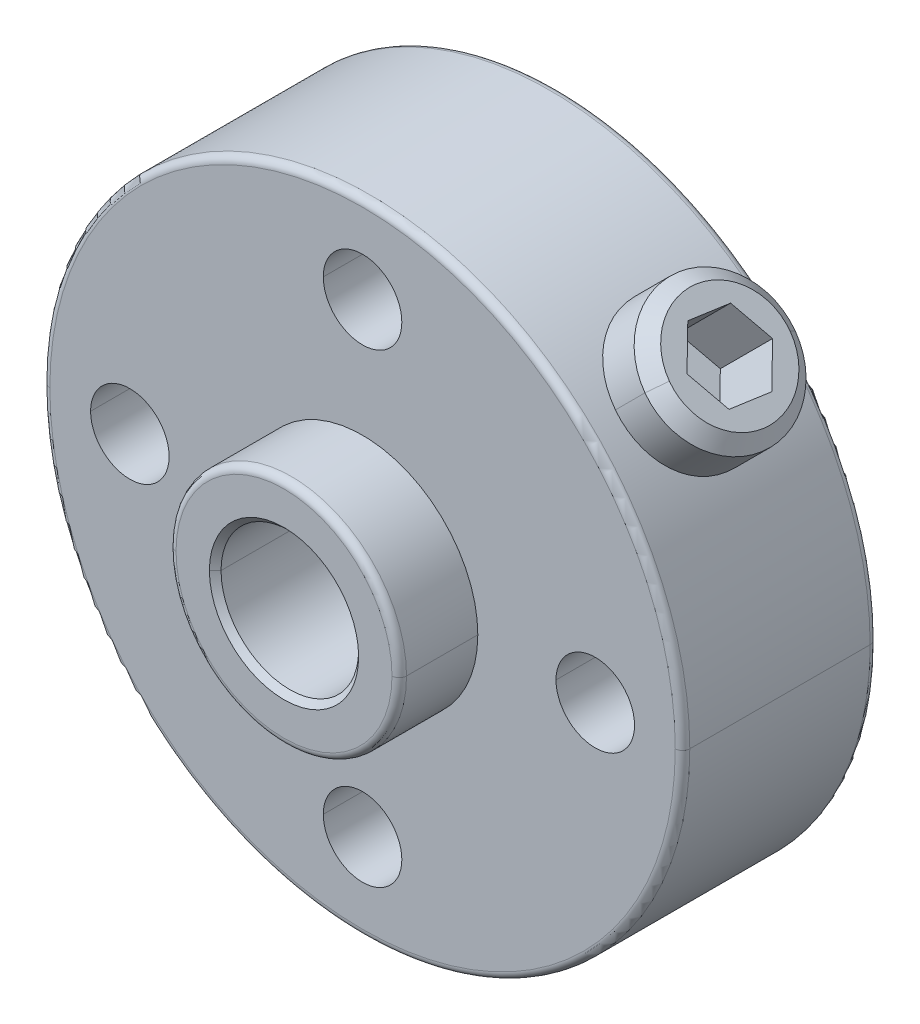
ISO-10303-21;
HEADER;
FILE_DESCRIPTION(('STEP AP214'),'2;1');
FILE_NAME('part.step','',(''),(''),'','','');
FILE_SCHEMA(('AUTOMOTIVE_DESIGN { 1 0 10303 214 1 1 1 1 }'));
ENDSEC;
DATA;
#1=APPLICATION_CONTEXT('core data for automotive mechanical design processes');
#2=APPLICATION_PROTOCOL_DEFINITION('international standard','automotive_design',2000,#1);
#3=PRODUCT_CONTEXT('',#1,'mechanical');
#4=PRODUCT('Part','Part','',(#3));
#5=PRODUCT_RELATED_PRODUCT_CATEGORY('part','',(#4));
#6=PRODUCT_DEFINITION_FORMATION('','',#4);
#7=PRODUCT_DEFINITION_CONTEXT('part definition',#1,'design');
#8=PRODUCT_DEFINITION('design','',#6,#7);
#9=PRODUCT_DEFINITION_SHAPE('','',#8);
#10=(LENGTH_UNIT() NAMED_UNIT(*) SI_UNIT(.MILLI.,.METRE.));
#11=(NAMED_UNIT(*) PLANE_ANGLE_UNIT() SI_UNIT($,.RADIAN.));
#12=(NAMED_UNIT(*) SI_UNIT($,.STERADIAN.) SOLID_ANGLE_UNIT());
#13=UNCERTAINTY_MEASURE_WITH_UNIT(LENGTH_MEASURE(1.E-05),#10,'distance_accuracy_value','');
#14=(GEOMETRIC_REPRESENTATION_CONTEXT(3) GLOBAL_UNCERTAINTY_ASSIGNED_CONTEXT((#13)) GLOBAL_UNIT_ASSIGNED_CONTEXT((#10,
#11,#12)) REPRESENTATION_CONTEXT('',''));
#15=CARTESIAN_POINT('',(0.,0.,0.));
#16=DIRECTION('',(0.,0.,1.));
#17=DIRECTION('',(1.,0.,0.));
#18=AXIS2_PLACEMENT_3D('',#15,#16,#17);
#19=CARTESIAN_POINT('',(9.00195284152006,5.65576630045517,-3.24344081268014));
#20=DIRECTION('',(-0.707106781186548,-0.707106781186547,0.));
#21=DIRECTION('',(-0.707106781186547,0.707106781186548,0.));
#22=AXIS2_PLACEMENT_3D('',#19,#20,#21);
#23=PLANE('',#22);
#24=DIRECTION('',(-0.646916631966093,0.646916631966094,0.403729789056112));
#25=VECTOR('',#24,1.);
#26=CARTESIAN_POINT('',(8.11303628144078,6.54468286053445,-2.68868293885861));
#27=LINE('',#26,#25);
#28=CARTESIAN_POINT('',(8.11303628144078,6.54468286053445,-2.68868293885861));
#29=VERTEX_POINT('',#28);
#30=CARTESIAN_POINT('',(7.2241197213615,7.43359942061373,-2.13392506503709));
#31=VERTEX_POINT('',#30);
#32=EDGE_CURVE('P0_E189',#29,#31,#27,.T.);
#33=ORIENTED_EDGE('',*,*,#32,.F.);
#34=DIRECTION('',(0.0762253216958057,-0.0762253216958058,-0.994172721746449));
#35=VECTOR('',#34,1.);
#36=CARTESIAN_POINT('',(8.11303628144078,6.54468286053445,-2.68868293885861));
#37=LINE('',#36,#35);
#38=CARTESIAN_POINT('',(8.21777613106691,6.43994301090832,-4.05475787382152));
#39=VERTEX_POINT('',#38);
#40=EDGE_CURVE('P0_E11',#29,#39,#37,.T.);
#41=ORIENTED_EDGE('',*,*,#40,.T.);
#42=DIRECTION('',(-0.570691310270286,0.570691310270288,-0.590442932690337));
#43=VECTOR('',#42,1.);
#44=CARTESIAN_POINT('',(8.21777613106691,6.43994301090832,-4.05475787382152));
#45=LINE('',#44,#43);
#46=CARTESIAN_POINT('',(7.43359942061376,7.22411972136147,-4.86607493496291));
#47=VERTEX_POINT('',#46);
#48=EDGE_CURVE('P0_E50',#39,#47,#45,.T.);
#49=ORIENTED_EDGE('',*,*,#48,.T.);
#50=DIRECTION('',(0.646916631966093,-0.646916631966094,-0.403729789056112));
#51=VECTOR('',#50,1.);
#52=CARTESIAN_POINT('',(6.54468286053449,8.11303628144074,-4.31131706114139));
#53=LINE('',#52,#51);
#54=CARTESIAN_POINT('',(6.54468286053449,8.11303628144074,-4.31131706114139));
#55=VERTEX_POINT('',#54);
#56=EDGE_CURVE('P0_E202',#55,#47,#53,.T.);
#57=ORIENTED_EDGE('',*,*,#56,.F.);
#58=DIRECTION('',(0.0762253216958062,-0.0762253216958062,-0.994172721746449));
#59=VECTOR('',#58,1.);
#60=CARTESIAN_POINT('',(6.43994301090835,8.21777613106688,-2.94524212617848));
#61=LINE('',#60,#59);
#62=CARTESIAN_POINT('',(6.43994301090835,8.21777613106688,-2.94524212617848));
#63=VERTEX_POINT('',#62);
#64=EDGE_CURVE('P0_E196',#63,#55,#61,.T.);
#65=ORIENTED_EDGE('',*,*,#64,.F.);
#66=DIRECTION('',(0.570691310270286,-0.570691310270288,0.590442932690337));
#67=VECTOR('',#66,1.);
#68=CARTESIAN_POINT('',(6.43994301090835,8.21777613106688,-2.94524212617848));
#69=LINE('',#68,#67);
#70=EDGE_CURVE('P0_E191',#63,#31,#69,.T.);
#71=ORIENTED_EDGE('',*,*,#70,.T.);
#72=EDGE_LOOP('',(#33,#41,#49,#57,#65,#71));
#73=FACE_BOUND('',#72,.T.);
#74=ADVANCED_FACE('P0_F18',(#73),#23,.F.);
#75=CARTESIAN_POINT('',(8.11303628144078,6.54468286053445,-2.68868293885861));
#76=DIRECTION('',(0.7029862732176,-0.702986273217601,0.107798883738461));
#77=DIRECTION('',(0.,-0.15157250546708,-0.988446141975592));
#78=AXIS2_PLACEMENT_3D('',#75,#76,#77);
#79=PLANE('',#78);
#80=DIRECTION('',(0.0762253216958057,-0.0762253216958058,-0.994172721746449));
#81=VECTOR('',#80,1.);
#82=CARTESIAN_POINT('',(9.90908750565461,8.34073408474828,-2.68868293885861));
#83=LINE('',#82,#81);
#84=CARTESIAN_POINT('',(9.90908750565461,8.34073408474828,-2.68868293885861));
#85=VERTEX_POINT('',#84);
#86=CARTESIAN_POINT('',(10.0138273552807,8.23599423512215,-4.05475787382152));
#87=VERTEX_POINT('',#86);
#88=EDGE_CURVE('P0_E138',#85,#87,#83,.T.);
#89=ORIENTED_EDGE('',*,*,#88,.T.);
#90=DIRECTION('',(0.707106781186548,0.707106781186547,0.));
#91=VECTOR('',#90,1.);
#92=CARTESIAN_POINT('',(8.21777613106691,6.43994301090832,-4.05475787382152));
#93=LINE('',#92,#91);
#94=EDGE_CURVE('P0_E22',#39,#87,#93,.T.);
#95=ORIENTED_EDGE('',*,*,#94,.F.);
#96=ORIENTED_EDGE('',*,*,#40,.F.);
#97=DIRECTION('',(0.707106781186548,0.707106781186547,0.));
#98=VECTOR('',#97,1.);
#99=CARTESIAN_POINT('',(8.11303628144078,6.54468286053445,-2.68868293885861));
#100=LINE('',#99,#98);
#101=EDGE_CURVE('P0_E190',#29,#85,#100,.T.);
#102=ORIENTED_EDGE('',*,*,#101,.T.);
#103=EDGE_LOOP('',(#89,#95,#96,#102));
#104=FACE_BOUND('',#103,.T.);
#105=ADVANCED_FACE('P0_F297',(#104),#79,.F.);
#106=CARTESIAN_POINT('',(8.21777613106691,6.43994301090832,-4.05475787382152));
#107=DIRECTION('',(0.41750620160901,-0.417506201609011,-0.807079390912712));
#108=DIRECTION('',(0.,-0.888194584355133,0.459467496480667));
#109=AXIS2_PLACEMENT_3D('',#106,#107,#108);
#110=PLANE('',#109);
#111=DIRECTION('',(-0.570691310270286,0.570691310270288,-0.590442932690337));
#112=VECTOR('',#111,1.);
#113=CARTESIAN_POINT('',(10.0138273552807,8.23599423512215,-4.05475787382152));
#114=LINE('',#113,#112);
#115=CARTESIAN_POINT('',(9.22965064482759,9.02017094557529,-4.86607493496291));
#116=VERTEX_POINT('',#115);
#117=EDGE_CURVE('P0_E180',#87,#116,#114,.T.);
#118=ORIENTED_EDGE('',*,*,#117,.T.);
#119=DIRECTION('',(0.707106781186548,0.707106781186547,0.));
#120=VECTOR('',#119,1.);
#121=CARTESIAN_POINT('',(7.43359942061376,7.22411972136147,-4.86607493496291));
#122=LINE('',#121,#120);
#123=EDGE_CURVE('P0_E208',#47,#116,#122,.T.);
#124=ORIENTED_EDGE('',*,*,#123,.F.);
#125=ORIENTED_EDGE('',*,*,#48,.F.);
#126=ORIENTED_EDGE('',*,*,#94,.T.);
#127=EDGE_LOOP('',(#118,#124,#125,#126));
#128=FACE_BOUND('',#127,.T.);
#129=ADVANCED_FACE('P0_F302',(#128),#110,.F.);
#130=CARTESIAN_POINT('',(6.54468286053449,8.11303628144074,-4.31131706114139));
#131=DIRECTION('',(0.285480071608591,-0.285480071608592,0.914878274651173));
#132=DIRECTION('',(-0.707106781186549,-0.707106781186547,0.));
#133=AXIS2_PLACEMENT_3D('',#130,#131,#132);
#134=PLANE('',#133);
#135=DIRECTION('',(0.646916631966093,-0.646916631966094,-0.403729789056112));
#136=VECTOR('',#135,1.);
#137=CARTESIAN_POINT('',(8.34073408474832,9.90908750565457,-4.31131706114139));
#138=LINE('',#137,#136);
#139=CARTESIAN_POINT('',(8.34073408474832,9.90908750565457,-4.31131706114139));
#140=VERTEX_POINT('',#139);
#141=EDGE_CURVE('P0_E174',#140,#116,#138,.T.);
#142=ORIENTED_EDGE('',*,*,#141,.F.);
#143=DIRECTION('',(0.707106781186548,0.707106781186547,0.));
#144=VECTOR('',#143,1.);
#145=CARTESIAN_POINT('',(6.54468286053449,8.11303628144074,-4.31131706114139));
#146=LINE('',#145,#144);
#147=EDGE_CURVE('P0_E205',#55,#140,#146,.T.);
#148=ORIENTED_EDGE('',*,*,#147,.F.);
#149=ORIENTED_EDGE('',*,*,#56,.T.);
#150=ORIENTED_EDGE('',*,*,#123,.T.);
#151=EDGE_LOOP('',(#142,#148,#149,#150));
#152=FACE_BOUND('',#151,.T.);
#153=ADVANCED_FACE('P0_F20',(#152),#134,.T.);
#154=CARTESIAN_POINT('',(6.43994301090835,8.21777613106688,-2.94524212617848));
#155=DIRECTION('',(0.7029862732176,-0.702986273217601,0.107798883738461));
#156=DIRECTION('',(0.,-0.151572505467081,-0.988446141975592));
#157=AXIS2_PLACEMENT_3D('',#154,#155,#156);
#158=PLANE('',#157);
#159=DIRECTION('',(0.0762253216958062,-0.0762253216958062,-0.994172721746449));
#160=VECTOR('',#159,1.);
#161=CARTESIAN_POINT('',(8.23599423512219,10.0138273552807,-2.94524212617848));
#162=LINE('',#161,#160);
#163=CARTESIAN_POINT('',(8.23599423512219,10.0138273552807,-2.94524212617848));
#164=VERTEX_POINT('',#163);
#165=EDGE_CURVE('P0_E166',#164,#140,#162,.T.);
#166=ORIENTED_EDGE('',*,*,#165,.F.);
#167=DIRECTION('',(0.707106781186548,0.707106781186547,0.));
#168=VECTOR('',#167,1.);
#169=CARTESIAN_POINT('',(6.43994301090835,8.21777613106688,-2.94524212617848));
#170=LINE('',#169,#168);
#171=EDGE_CURVE('P0_E192',#63,#164,#170,.T.);
#172=ORIENTED_EDGE('',*,*,#171,.F.);
#173=ORIENTED_EDGE('',*,*,#64,.T.);
#174=ORIENTED_EDGE('',*,*,#147,.T.);
#175=EDGE_LOOP('',(#166,#172,#173,#174));
#176=FACE_BOUND('',#175,.T.);
#177=ADVANCED_FACE('P0_F315',(#176),#158,.T.);
#178=CARTESIAN_POINT('',(6.43994301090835,8.21777613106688,-2.94524212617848));
#179=DIRECTION('',(-0.417506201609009,0.41750620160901,0.807079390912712));
#180=DIRECTION('',(0.707106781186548,0.707106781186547,0.));
#181=AXIS2_PLACEMENT_3D('',#178,#179,#180);
#182=PLANE('',#181);
#183=DIRECTION('',(0.570691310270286,-0.570691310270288,0.590442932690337));
#184=VECTOR('',#183,1.);
#185=CARTESIAN_POINT('',(8.23599423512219,10.0138273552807,-2.94524212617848));
#186=LINE('',#185,#184);
#187=CARTESIAN_POINT('',(9.02017094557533,9.22965064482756,-2.13392506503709));
#188=VERTEX_POINT('',#187);
#189=EDGE_CURVE('P0_E164',#164,#188,#186,.T.);
#190=ORIENTED_EDGE('',*,*,#189,.T.);
#191=DIRECTION('',(0.707106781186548,0.707106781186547,0.));
#192=VECTOR('',#191,1.);
#193=CARTESIAN_POINT('',(7.2241197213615,7.43359942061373,-2.13392506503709));
#194=LINE('',#193,#192);
#195=EDGE_CURVE('P0_E194',#31,#188,#194,.T.);
#196=ORIENTED_EDGE('',*,*,#195,.F.);
#197=ORIENTED_EDGE('',*,*,#70,.F.);
#198=ORIENTED_EDGE('',*,*,#171,.T.);
#199=EDGE_LOOP('',(#190,#196,#197,#198));
#200=FACE_BOUND('',#199,.T.);
#201=ADVANCED_FACE('P0_F309',(#200),#182,.F.);
#202=CARTESIAN_POINT('',(8.11303628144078,6.54468286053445,-2.68868293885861));
#203=DIRECTION('',(-0.285480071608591,0.285480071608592,-0.914878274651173));
#204=DIRECTION('',(-0.954604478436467,0.,0.297876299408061));
#205=AXIS2_PLACEMENT_3D('',#202,#203,#204);
#206=PLANE('',#205);
#207=DIRECTION('',(-0.646916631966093,0.646916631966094,0.403729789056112));
#208=VECTOR('',#207,1.);
#209=CARTESIAN_POINT('',(9.90908750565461,8.34073408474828,-2.68868293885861));
#210=LINE('',#209,#208);
#211=EDGE_CURVE('P0_E161',#85,#188,#210,.T.);
#212=ORIENTED_EDGE('',*,*,#211,.F.);
#213=ORIENTED_EDGE('',*,*,#101,.F.);
#214=ORIENTED_EDGE('',*,*,#32,.T.);
#215=ORIENTED_EDGE('',*,*,#195,.T.);
#216=EDGE_LOOP('',(#212,#213,#214,#215));
#217=FACE_BOUND('',#216,.T.);
#218=ADVANCED_FACE('P0_F306',(#217),#206,.T.);
#219=CARTESIAN_POINT('',(-703.044150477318,-703.044150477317,-3.50000000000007));
#220=DIRECTION('',(-0.707106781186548,-0.707106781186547,0.));
#221=DIRECTION('',(0.0762253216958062,-0.0762253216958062,-0.994172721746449));
#222=AXIS2_PLACEMENT_3D('',#219,#220,#221);
#223=CONICAL_SURFACE('',#222,1664.27948235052,1.02974425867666);
#224=DIRECTION('',(-0.429524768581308,-0.298849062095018,0.852172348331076));
#225=VECTOR('',#224,1.);
#226=CARTESIAN_POINT('',(4.06263070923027,4.06263070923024,-3.5));
#227=LINE('',#226,#225);
#228=CARTESIAN_POINT('',(4.06263070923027,4.06263070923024,-3.5));
#229=VERTEX_POINT('',#228);
#230=CARTESIAN_POINT('',(3.41350843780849,3.61099300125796,-2.21214865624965));
#231=VERTEX_POINT('',#230);
#232=EDGE_CURVE('P0_E224',#229,#231,#227,.T.);
#233=ORIENTED_EDGE('',*,*,#232,.F.);
#234=DIRECTION('',(-0.298849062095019,-0.429524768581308,-0.852172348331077));
#235=VECTOR('',#234,1.);
#236=CARTESIAN_POINT('',(4.06263070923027,4.06263070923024,-3.5));
#237=LINE('',#236,#235);
#238=CARTESIAN_POINT('',(3.61099300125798,3.41350843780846,-4.78785134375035));
#239=VERTEX_POINT('',#238);
#240=EDGE_CURVE('P0_E262',#229,#239,#237,.T.);
#241=ORIENTED_EDGE('',*,*,#240,.T.);
#242=CARTESIAN_POINT('',(3.51225071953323,3.51225071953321,-3.5));
#243=DIRECTION('',(0.707106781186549,0.707106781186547,0.));
#244=DIRECTION('',(-0.0762253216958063,0.0762253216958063,0.994172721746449));
#245=AXIS2_PLACEMENT_3D('',#242,#243,#244);
#246=CIRCLE('',#245,1.2954);
#247=EDGE_CURVE('P0_E231',#231,#239,#246,.T.);
#248=ORIENTED_EDGE('',*,*,#247,.F.);
#249=EDGE_LOOP('',(#233,#241,#248));
#250=FACE_BOUND('',#249,.T.);
#251=ADVANCED_FACE('P0_F280',(#250),#223,.F.);
#252=CARTESIAN_POINT('',(4.30251325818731,4.30251325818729,-3.5));
#253=DIRECTION('',(0.707106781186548,0.707106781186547,0.));
#254=DIRECTION('',(-0.0762253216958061,0.0762253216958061,0.994172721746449));
#255=AXIS2_PLACEMENT_3D('',#252,#253,#254);
#256=CONICAL_SURFACE('',#255,2.413,0.785398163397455);
#257=DIRECTION('',(0.553899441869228,0.446100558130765,-0.702986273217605));
#258=VECTOR('',#257,1.);
#259=CARTESIAN_POINT('',(4.48644495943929,4.11858155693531,-5.89893877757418));
#260=LINE('',#259,#258);
#261=CARTESIAN_POINT('',(4.48644495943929,4.11858155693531,-5.89893877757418));
#262=VERTEX_POINT('',#261);
#263=EDGE_CURVE('P0_E238',#239,#262,#260,.T.);
#264=ORIENTED_EDGE('',*,*,#263,.F.);
#265=CARTESIAN_POINT('',(3.51225071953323,3.51225071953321,-3.5));
#266=DIRECTION('',(0.707106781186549,0.707106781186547,0.));
#267=DIRECTION('',(-0.0762253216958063,0.0762253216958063,0.994172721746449));
#268=AXIS2_PLACEMENT_3D('',#265,#266,#267);
#269=CIRCLE('',#268,1.2954);
#270=EDGE_CURVE('P0_E227',#239,#231,#269,.T.);
#271=ORIENTED_EDGE('',*,*,#270,.T.);
#272=DIRECTION('',(0.446100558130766,0.553899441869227,0.702986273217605));
#273=VECTOR('',#272,1.);
#274=CARTESIAN_POINT('',(4.11858155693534,4.48644495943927,-1.10106122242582));
#275=LINE('',#274,#273);
#276=CARTESIAN_POINT('',(4.11858155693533,4.48644495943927,-1.10106122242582));
#277=VERTEX_POINT('',#276);
#278=EDGE_CURVE('P0_E250',#231,#277,#275,.T.);
#279=ORIENTED_EDGE('',*,*,#278,.T.);
#280=CARTESIAN_POINT('',(4.30251325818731,4.30251325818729,-3.5));
#281=DIRECTION('',(0.707106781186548,0.707106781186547,0.));
#282=DIRECTION('',(-0.0762253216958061,0.0762253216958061,0.994172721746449));
#283=AXIS2_PLACEMENT_3D('',#280,#281,#282);
#284=CIRCLE('',#283,2.413);
#285=EDGE_CURVE('P0_E182',#262,#277,#284,.T.);
#286=ORIENTED_EDGE('',*,*,#285,.F.);
#287=EDGE_LOOP('',(#264,#271,#279,#286));
#288=FACE_BOUND('',#287,.T.);
#289=ADVANCED_FACE('P0_F276',(#288),#256,.T.);
#290=CARTESIAN_POINT('',(18.1051669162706,18.1051669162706,-3.5));
#291=DIRECTION('',(0.707106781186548,0.707106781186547,0.));
#292=DIRECTION('',(-0.0762253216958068,0.0762253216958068,0.994172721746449));
#293=AXIS2_PLACEMENT_3D('',#290,#291,#292);
#294=CYLINDRICAL_SURFACE('',#293,2.413);
#295=DIRECTION('',(0.707106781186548,0.707106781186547,0.));
#296=VECTOR('',#295,1.);
#297=CARTESIAN_POINT('',(18.2890986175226,17.9212352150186,-5.89893877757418));
#298=LINE('',#297,#296);
#299=CARTESIAN_POINT('',(8.97477696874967,8.60691356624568,-5.89893877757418));
#300=VERTEX_POINT('',#299);
#301=EDGE_CURVE('P0_E248',#262,#300,#298,.T.);
#302=ORIENTED_EDGE('',*,*,#301,.F.);
#303=ORIENTED_EDGE('',*,*,#285,.T.);
#304=DIRECTION('',(0.707106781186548,0.707106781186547,0.));
#305=VECTOR('',#304,1.);
#306=CARTESIAN_POINT('',(17.9212352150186,18.2890986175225,-1.10106122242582));
#307=LINE('',#306,#305);
#308=CARTESIAN_POINT('',(8.60691356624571,8.97477696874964,-1.10106122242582));
#309=VERTEX_POINT('',#308);
#310=EDGE_CURVE('P0_E147',#277,#309,#307,.T.);
#311=ORIENTED_EDGE('',*,*,#310,.T.);
#312=CARTESIAN_POINT('',(8.79084526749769,8.79084526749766,-3.5));
#313=DIRECTION('',(0.707106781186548,0.707106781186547,0.));
#314=DIRECTION('',(-0.0762253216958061,0.0762253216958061,0.994172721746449));
#315=AXIS2_PLACEMENT_3D('',#312,#313,#314);
#316=CIRCLE('',#315,2.413);
#317=EDGE_CURVE('P0_E179',#300,#309,#316,.T.);
#318=ORIENTED_EDGE('',*,*,#317,.F.);
#319=EDGE_LOOP('',(#302,#303,#311,#318));
#320=FACE_BOUND('',#319,.T.);
#321=ADVANCED_FACE('P0_F283',(#320),#294,.T.);
#322=CARTESIAN_POINT('',(9.12491079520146,9.12491079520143,-3.5));
#323=DIRECTION('',(-0.707106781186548,-0.707106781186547,0.));
#324=DIRECTION('',(0.0762253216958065,-0.0762253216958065,-0.994172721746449));
#325=AXIS2_PLACEMENT_3D('',#322,#323,#324);
#326=CONICAL_SURFACE('',#325,1.94056,0.785398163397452);
#327=DIRECTION('',(-0.553899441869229,-0.446100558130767,0.702986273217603));
#328=VECTOR('',#327,1.);
#329=CARTESIAN_POINT('',(8.97699098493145,9.27283060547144,-1.57074818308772));
#330=LINE('',#329,#328);
#331=CARTESIAN_POINT('',(8.97699098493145,9.27283060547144,-1.57074818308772));
#332=VERTEX_POINT('',#331);
#333=EDGE_CURVE('P0_E132',#332,#309,#330,.T.);
#334=ORIENTED_EDGE('',*,*,#333,.F.);
#335=CARTESIAN_POINT('',(9.12491079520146,9.12491079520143,-3.5));
#336=DIRECTION('',(0.707106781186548,0.707106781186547,0.));
#337=DIRECTION('',(-0.0762253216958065,0.0762253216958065,0.994172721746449));
#338=AXIS2_PLACEMENT_3D('',#335,#336,#337);
#339=CIRCLE('',#338,1.94056);
#340=CARTESIAN_POINT('',(9.27283060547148,8.97699098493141,-5.42925181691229));
#341=VERTEX_POINT('',#340);
#342=EDGE_CURVE('P0_E126',#341,#332,#339,.T.);
#343=ORIENTED_EDGE('',*,*,#342,.F.);
#344=DIRECTION('',(-0.446100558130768,-0.553899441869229,-0.702986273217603));
#345=VECTOR('',#344,1.);
#346=CARTESIAN_POINT('',(9.27283060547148,8.97699098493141,-5.42925181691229));
#347=LINE('',#346,#345);
#348=EDGE_CURVE('P0_E129',#341,#300,#347,.T.);
#349=ORIENTED_EDGE('',*,*,#348,.T.);
#350=ORIENTED_EDGE('',*,*,#317,.T.);
#351=EDGE_LOOP('',(#334,#343,#349,#350));
#352=FACE_BOUND('',#351,.T.);
#353=ADVANCED_FACE('P0_F127',(#352),#326,.T.);
#354=CARTESIAN_POINT('',(9.12491079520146,9.12491079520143,-3.5));
#355=DIRECTION('',(0.707106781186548,0.707106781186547,0.));
#356=DIRECTION('',(0.,0.,-1.));
#357=AXIS2_PLACEMENT_3D('',#354,#355,#356);
#358=PLANE('',#357);
#359=ORIENTED_EDGE('',*,*,#88,.F.);
#360=ORIENTED_EDGE('',*,*,#211,.T.);
#361=ORIENTED_EDGE('',*,*,#189,.F.);
#362=ORIENTED_EDGE('',*,*,#165,.T.);
#363=ORIENTED_EDGE('',*,*,#141,.T.);
#364=ORIENTED_EDGE('',*,*,#117,.F.);
#365=EDGE_LOOP('',(#359,#360,#361,#362,#363,#364));
#366=FACE_BOUND('',#365,.T.);
#367=ORIENTED_EDGE('',*,*,#342,.T.);
#368=CARTESIAN_POINT('',(9.12491079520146,9.12491079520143,-3.5));
#369=DIRECTION('',(0.707106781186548,0.707106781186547,0.));
#370=DIRECTION('',(-0.0762253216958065,0.0762253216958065,0.994172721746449));
#371=AXIS2_PLACEMENT_3D('',#368,#369,#370);
#372=CIRCLE('',#371,1.94056);
#373=EDGE_CURVE('P0_E142',#332,#341,#372,.T.);
#374=ORIENTED_EDGE('',*,*,#373,.T.);
#375=EDGE_LOOP('',(#367,#374));
#376=FACE_BOUND('',#375,.T.);
#377=ADVANCED_FACE('P0_F146',(#366,#376),#358,.T.);
#378=CARTESIAN_POINT('',(9.12491079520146,9.12491079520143,-3.5));
#379=DIRECTION('',(-0.707106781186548,-0.707106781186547,0.));
#380=DIRECTION('',(0.0762253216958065,-0.0762253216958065,-0.994172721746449));
#381=AXIS2_PLACEMENT_3D('',#378,#379,#380);
#382=CONICAL_SURFACE('',#381,1.94056,0.785398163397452);
#383=ORIENTED_EDGE('',*,*,#373,.F.);
#384=ORIENTED_EDGE('',*,*,#333,.T.);
#385=CARTESIAN_POINT('',(8.79084526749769,8.79084526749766,-3.5));
#386=DIRECTION('',(0.707106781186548,0.707106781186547,0.));
#387=DIRECTION('',(-0.0762253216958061,0.0762253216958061,0.994172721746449));
#388=AXIS2_PLACEMENT_3D('',#385,#386,#387);
#389=CIRCLE('',#388,2.413);
#390=EDGE_CURVE('P0_E145',#309,#300,#389,.T.);
#391=ORIENTED_EDGE('',*,*,#390,.T.);
#392=ORIENTED_EDGE('',*,*,#348,.F.);
#393=EDGE_LOOP('',(#383,#384,#391,#392));
#394=FACE_BOUND('',#393,.T.);
#395=ADVANCED_FACE('P0_F143',(#394),#382,.T.);
#396=CARTESIAN_POINT('',(18.1051669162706,18.1051669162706,-3.5));
#397=DIRECTION('',(0.707106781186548,0.707106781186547,0.));
#398=DIRECTION('',(-0.0762253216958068,0.0762253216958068,0.994172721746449));
#399=AXIS2_PLACEMENT_3D('',#396,#397,#398);
#400=CYLINDRICAL_SURFACE('',#399,2.413);
#401=CARTESIAN_POINT('',(4.30251325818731,4.30251325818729,-3.5));
#402=DIRECTION('',(0.707106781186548,0.707106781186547,0.));
#403=DIRECTION('',(-0.0762253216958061,0.0762253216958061,0.994172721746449));
#404=AXIS2_PLACEMENT_3D('',#401,#402,#403);
#405=CIRCLE('',#404,2.413);
#406=EDGE_CURVE('P0_E243',#277,#262,#405,.T.);
#407=ORIENTED_EDGE('',*,*,#406,.T.);
#408=ORIENTED_EDGE('',*,*,#301,.T.);
#409=ORIENTED_EDGE('',*,*,#390,.F.);
#410=ORIENTED_EDGE('',*,*,#310,.F.);
#411=EDGE_LOOP('',(#407,#408,#409,#410));
#412=FACE_BOUND('',#411,.T.);
#413=ADVANCED_FACE('P0_F282',(#412),#400,.T.);
#414=CARTESIAN_POINT('',(4.30251325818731,4.30251325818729,-3.5));
#415=DIRECTION('',(0.707106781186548,0.707106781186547,0.));
#416=DIRECTION('',(-0.0762253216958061,0.0762253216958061,0.994172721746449));
#417=AXIS2_PLACEMENT_3D('',#414,#415,#416);
#418=CONICAL_SURFACE('',#417,2.413,0.785398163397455);
#419=ORIENTED_EDGE('',*,*,#247,.T.);
#420=ORIENTED_EDGE('',*,*,#263,.T.);
#421=ORIENTED_EDGE('',*,*,#406,.F.);
#422=ORIENTED_EDGE('',*,*,#278,.F.);
#423=EDGE_LOOP('',(#419,#420,#421,#422));
#424=FACE_BOUND('',#423,.T.);
#425=ADVANCED_FACE('P0_F278',(#424),#418,.T.);
#426=CARTESIAN_POINT('',(-703.044150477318,-703.044150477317,-3.50000000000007));
#427=DIRECTION('',(-0.707106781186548,-0.707106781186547,0.));
#428=DIRECTION('',(0.0762253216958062,-0.0762253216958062,-0.994172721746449));
#429=AXIS2_PLACEMENT_3D('',#426,#427,#428);
#430=CONICAL_SURFACE('',#429,1664.27948235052,1.02974425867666);
#431=ORIENTED_EDGE('',*,*,#240,.F.);
#432=ORIENTED_EDGE('',*,*,#232,.T.);
#433=ORIENTED_EDGE('',*,*,#270,.F.);
#434=EDGE_LOOP('',(#431,#432,#433));
#435=FACE_BOUND('',#434,.T.);
#436=ADVANCED_FACE('P0_F277',(#435),#430,.F.);
#437=CLOSED_SHELL('',(#74,#105,#129,#153,#177,#201,#218,#251,#289,#321,#353,#377,#395,#413,#425,#436));
#438=MANIFOLD_SOLID_BREP('P0_B1',#437);
#439=CARTESIAN_POINT('',(0.,0.,2.45));
#440=DIRECTION('',(0.,0.,1.));
#441=DIRECTION('',(1.,0.,0.));
#442=AXIS2_PLACEMENT_3D('',#439,#440,#441);
#443=TOROIDAL_SURFACE('',#442,3.7125,0.25);
#444=CARTESIAN_POINT('',(-3.7125,0.,2.45));
#445=DIRECTION('',(0.,1.,0.));
#446=DIRECTION('',(-1.,0.,0.));
#447=AXIS2_PLACEMENT_3D('',#444,#445,#446);
#448=CIRCLE('',#447,0.25);
#449=CARTESIAN_POINT('',(-3.9625,0.,2.45));
#450=VERTEX_POINT('',#449);
#451=CARTESIAN_POINT('',(-3.7125,0.,2.7));
#452=VERTEX_POINT('',#451);
#453=EDGE_CURVE('P1_E511',#450,#452,#448,.T.);
#454=ORIENTED_EDGE('',*,*,#453,.F.);
#455=CARTESIAN_POINT('',(0.,0.,2.45));
#456=DIRECTION('',(0.,0.,-1.));
#457=DIRECTION('',(1.,0.,0.));
#458=AXIS2_PLACEMENT_3D('',#455,#456,#457);
#459=CIRCLE('',#458,3.9625);
#460=CARTESIAN_POINT('',(3.9625,0.,2.45));
#461=VERTEX_POINT('',#460);
#462=EDGE_CURVE('P1_E338',#461,#450,#459,.T.);
#463=ORIENTED_EDGE('',*,*,#462,.F.);
#464=CARTESIAN_POINT('',(3.7125,0.,2.45));
#465=DIRECTION('',(0.,-1.,0.));
#466=DIRECTION('',(0.,0.,-1.));
#467=AXIS2_PLACEMENT_3D('',#464,#465,#466);
#468=CIRCLE('',#467,0.25);
#469=CARTESIAN_POINT('',(3.7125,0.,2.7));
#470=VERTEX_POINT('',#469);
#471=EDGE_CURVE('P1_E506',#461,#470,#468,.T.);
#472=ORIENTED_EDGE('',*,*,#471,.T.);
#473=CARTESIAN_POINT('',(0.,0.,2.7));
#474=DIRECTION('',(0.,0.,1.));
#475=DIRECTION('',(1.,0.,0.));
#476=AXIS2_PLACEMENT_3D('',#473,#474,#475);
#477=CIRCLE('',#476,3.7125);
#478=EDGE_CURVE('P1_E340',#452,#470,#477,.T.);
#479=ORIENTED_EDGE('',*,*,#478,.F.);
#480=EDGE_LOOP('',(#454,#463,#472,#479));
#481=FACE_BOUND('',#480,.T.);
#482=ADVANCED_FACE('P1_F18',(#481),#443,.T.);
#483=CARTESIAN_POINT('',(0.,0.,-0.25));
#484=DIRECTION('',(0.,0.,1.));
#485=DIRECTION('',(1.,0.,0.));
#486=AXIS2_PLACEMENT_3D('',#483,#484,#485);
#487=TOROIDAL_SURFACE('',#486,10.75,0.25);
#488=CARTESIAN_POINT('',(-10.75,0.,-0.25));
#489=DIRECTION('',(0.,1.,0.));
#490=DIRECTION('',(-1.,0.,0.));
#491=AXIS2_PLACEMENT_3D('',#488,#489,#490);
#492=CIRCLE('',#491,0.25);
#493=CARTESIAN_POINT('',(-11.,0.,-0.25));
#494=VERTEX_POINT('',#493);
#495=CARTESIAN_POINT('',(-10.75,0.,0.));
#496=VERTEX_POINT('',#495);
#497=EDGE_CURVE('P1_E500',#494,#496,#492,.T.);
#498=ORIENTED_EDGE('',*,*,#497,.F.);
#499=CARTESIAN_POINT('',(0.,0.,-0.25));
#500=DIRECTION('',(0.,0.,-1.));
#501=DIRECTION('',(1.,0.,0.));
#502=AXIS2_PLACEMENT_3D('',#499,#500,#501);
#503=CIRCLE('',#502,11.);
#504=CARTESIAN_POINT('',(11.,0.,-0.25));
#505=VERTEX_POINT('',#504);
#506=EDGE_CURVE('P1_E315',#505,#494,#503,.T.);
#507=ORIENTED_EDGE('',*,*,#506,.F.);
#508=CARTESIAN_POINT('',(10.75,0.,-0.25));
#509=DIRECTION('',(0.,-1.,0.));
#510=DIRECTION('',(0.,0.,-1.));
#511=AXIS2_PLACEMENT_3D('',#508,#509,#510);
#512=CIRCLE('',#511,0.25);
#513=CARTESIAN_POINT('',(10.75,0.,0.));
#514=VERTEX_POINT('',#513);
#515=EDGE_CURVE('P1_E497',#505,#514,#512,.T.);
#516=ORIENTED_EDGE('',*,*,#515,.T.);
#517=CARTESIAN_POINT('',(0.,0.,0.));
#518=DIRECTION('',(0.,0.,1.));
#519=DIRECTION('',(1.,0.,0.));
#520=AXIS2_PLACEMENT_3D('',#517,#518,#519);
#521=CIRCLE('',#520,10.75);
#522=EDGE_CURVE('P1_E308',#496,#514,#521,.T.);
#523=ORIENTED_EDGE('',*,*,#522,.F.);
#524=EDGE_LOOP('',(#498,#507,#516,#523));
#525=FACE_BOUND('',#524,.T.);
#526=ADVANCED_FACE('P1_F611',(#525),#487,.T.);
#527=CARTESIAN_POINT('',(0.,0.,-6.45));
#528=DIRECTION('',(0.,0.,1.));
#529=DIRECTION('',(1.,0.,0.));
#530=AXIS2_PLACEMENT_3D('',#527,#528,#529);
#531=TOROIDAL_SURFACE('',#530,10.75,0.25);
#532=CARTESIAN_POINT('',(-10.75,0.,-6.45));
#533=DIRECTION('',(0.,1.,0.));
#534=DIRECTION('',(-1.,0.,0.));
#535=AXIS2_PLACEMENT_3D('',#532,#533,#534);
#536=CIRCLE('',#535,0.25);
#537=CARTESIAN_POINT('',(-10.75,0.,-6.7));
#538=VERTEX_POINT('',#537);
#539=CARTESIAN_POINT('',(-11.,0.,-6.45));
#540=VERTEX_POINT('',#539);
#541=EDGE_CURVE('P1_E535',#538,#540,#536,.T.);
#542=ORIENTED_EDGE('',*,*,#541,.F.);
#543=CARTESIAN_POINT('',(0.,0.,-6.7));
#544=DIRECTION('',(0.,0.,-1.));
#545=DIRECTION('',(1.,0.,0.));
#546=AXIS2_PLACEMENT_3D('',#543,#544,#545);
#547=CIRCLE('',#546,10.75);
#548=CARTESIAN_POINT('',(10.75,0.,-6.7));
#549=VERTEX_POINT('',#548);
#550=EDGE_CURVE('P1_E309',#549,#538,#547,.T.);
#551=ORIENTED_EDGE('',*,*,#550,.F.);
#552=CARTESIAN_POINT('',(10.75,0.,-6.45));
#553=DIRECTION('',(0.,-1.,0.));
#554=DIRECTION('',(0.,0.,-1.));
#555=AXIS2_PLACEMENT_3D('',#552,#553,#554);
#556=CIRCLE('',#555,0.25);
#557=CARTESIAN_POINT('',(11.,0.,-6.45));
#558=VERTEX_POINT('',#557);
#559=EDGE_CURVE('P1_E532',#549,#558,#556,.T.);
#560=ORIENTED_EDGE('',*,*,#559,.T.);
#561=CARTESIAN_POINT('',(0.,0.,-6.45));
#562=DIRECTION('',(0.,0.,1.));
#563=DIRECTION('',(1.,0.,0.));
#564=AXIS2_PLACEMENT_3D('',#561,#562,#563);
#565=CIRCLE('',#564,11.);
#566=EDGE_CURVE('P1_E312',#540,#558,#565,.T.);
#567=ORIENTED_EDGE('',*,*,#566,.F.);
#568=EDGE_LOOP('',(#542,#551,#560,#567));
#569=FACE_BOUND('',#568,.T.);
#570=ADVANCED_FACE('P1_F579',(#569),#531,.T.);
#571=CARTESIAN_POINT('',(0.,0.,2.5));
#572=DIRECTION('',(0.,0.,1.));
#573=DIRECTION('',(1.,0.,0.));
#574=AXIS2_PLACEMENT_3D('',#571,#572,#573);
#575=CONICAL_SURFACE('',#574,2.365,0.785398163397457);
#576=DIRECTION('',(-0.707106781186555,0.,0.707106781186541));
#577=VECTOR('',#576,1.);
#578=CARTESIAN_POINT('',(-2.365,0.,2.5));
#579=LINE('',#578,#577);
#580=CARTESIAN_POINT('',(-2.365,0.,2.5));
#581=VERTEX_POINT('',#580);
#582=CARTESIAN_POINT('',(-2.565,0.,2.7));
#583=VERTEX_POINT('',#582);
#584=EDGE_CURVE('P1_E549',#581,#583,#579,.T.);
#585=ORIENTED_EDGE('',*,*,#584,.F.);
#586=CARTESIAN_POINT('',(0.,0.,2.5));
#587=DIRECTION('',(0.,0.,1.));
#588=DIRECTION('',(1.,0.,0.));
#589=AXIS2_PLACEMENT_3D('',#586,#587,#588);
#590=CIRCLE('',#589,2.365);
#591=CARTESIAN_POINT('',(2.365,0.,2.5));
#592=VERTEX_POINT('',#591);
#593=EDGE_CURVE('P1_E11',#592,#581,#590,.T.);
#594=ORIENTED_EDGE('',*,*,#593,.F.);
#595=DIRECTION('',(0.707106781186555,0.,0.707106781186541));
#596=VECTOR('',#595,1.);
#597=CARTESIAN_POINT('',(2.365,0.,2.5));
#598=LINE('',#597,#596);
#599=CARTESIAN_POINT('',(2.565,0.,2.7));
#600=VERTEX_POINT('',#599);
#601=EDGE_CURVE('P1_E548',#592,#600,#598,.T.);
#602=ORIENTED_EDGE('',*,*,#601,.T.);
#603=CARTESIAN_POINT('',(0.,0.,2.7));
#604=DIRECTION('',(0.,0.,-1.));
#605=DIRECTION('',(1.,0.,0.));
#606=AXIS2_PLACEMENT_3D('',#603,#604,#605);
#607=CIRCLE('',#606,2.565);
#608=EDGE_CURVE('P1_E337',#583,#600,#607,.T.);
#609=ORIENTED_EDGE('',*,*,#608,.F.);
#610=EDGE_LOOP('',(#585,#594,#602,#609));
#611=FACE_BOUND('',#610,.T.);
#612=ADVANCED_FACE('P1_F616',(#611),#575,.F.);
#613=CARTESIAN_POINT('',(0.,0.,-6.7));
#614=DIRECTION('',(0.,0.,-1.));
#615=DIRECTION('',(-1.,0.,0.));
#616=AXIS2_PLACEMENT_3D('',#613,#614,#615);
#617=CONICAL_SURFACE('',#616,2.565,0.785398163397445);
#618=DIRECTION('',(0.707106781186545,0.,-0.70710678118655));
#619=VECTOR('',#618,1.);
#620=CARTESIAN_POINT('',(2.565,0.,-6.7));
#621=LINE('',#620,#619);
#622=CARTESIAN_POINT('',(2.365,0.,-6.5));
#623=VERTEX_POINT('',#622);
#624=CARTESIAN_POINT('',(2.565,0.,-6.7));
#625=VERTEX_POINT('',#624);
#626=EDGE_CURVE('P1_E450',#623,#625,#621,.T.);
#627=ORIENTED_EDGE('',*,*,#626,.F.);
#628=CARTESIAN_POINT('',(0.,0.,-6.5));
#629=DIRECTION('',(0.,0.,-1.));
#630=DIRECTION('',(1.,0.,0.));
#631=AXIS2_PLACEMENT_3D('',#628,#629,#630);
#632=CIRCLE('',#631,2.365);
#633=CARTESIAN_POINT('',(-2.365,0.,-6.5));
#634=VERTEX_POINT('',#633);
#635=EDGE_CURVE('P1_E343',#634,#623,#632,.T.);
#636=ORIENTED_EDGE('',*,*,#635,.F.);
#637=DIRECTION('',(-0.707106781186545,0.,-0.70710678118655));
#638=VECTOR('',#637,1.);
#639=CARTESIAN_POINT('',(-2.565,0.,-6.7));
#640=LINE('',#639,#638);
#641=CARTESIAN_POINT('',(-2.565,0.,-6.7));
#642=VERTEX_POINT('',#641);
#643=EDGE_CURVE('P1_E432',#634,#642,#640,.T.);
#644=ORIENTED_EDGE('',*,*,#643,.T.);
#645=CARTESIAN_POINT('',(0.,0.,-6.7));
#646=DIRECTION('',(0.,0.,1.));
#647=DIRECTION('',(1.,0.,0.));
#648=AXIS2_PLACEMENT_3D('',#645,#646,#647);
#649=CIRCLE('',#648,2.565);
#650=EDGE_CURVE('P1_E306',#625,#642,#649,.T.);
#651=ORIENTED_EDGE('',*,*,#650,.F.);
#652=EDGE_LOOP('',(#627,#636,#644,#651));
#653=FACE_BOUND('',#652,.T.);
#654=ADVANCED_FACE('P1_F567',(#653),#617,.F.);
#655=CARTESIAN_POINT('',(11.,11.,-3.5));
#656=DIRECTION('',(-0.707106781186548,-0.707106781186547,0.));
#657=DIRECTION('',(0.707106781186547,-0.707106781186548,0.));
#658=AXIS2_PLACEMENT_3D('',#655,#656,#657);
#659=CYLINDRICAL_SURFACE('',#658,2.);
#660=DIRECTION('',(-0.707106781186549,-0.707106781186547,0.));
#661=VECTOR('',#660,1.);
#662=CARTESIAN_POINT('',(9.58578643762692,12.4142135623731,-3.5));
#663=LINE('',#662,#661);
#664=CARTESIAN_POINT('',(6.2343157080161,9.06274283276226,-3.5));
#665=VERTEX_POINT('',#664);
#666=CARTESIAN_POINT('',(-0.521682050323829,2.30674507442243,-3.49999999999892));
#667=VERTEX_POINT('',#666);
#668=EDGE_CURVE('P1_E433',#665,#667,#663,.T.);
#669=ORIENTED_EDGE('',*,*,#668,.F.);
#670=CARTESIAN_POINT('',(6.23431570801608,9.06274283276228,-3.5));
#671=CARTESIAN_POINT('',(6.23431535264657,9.06274339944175,-3.46887091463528));
#672=CARTESIAN_POINT('',(6.23493076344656,9.0623301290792,-3.43774196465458));
#673=CARTESIAN_POINT('',(6.23739968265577,9.06065853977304,-3.37509228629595));
#674=CARTESIAN_POINT('',(6.23927144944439,9.05938775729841,-3.34357260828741));
#675=CARTESIAN_POINT('',(6.24429592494,9.05595821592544,-3.28021584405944));
#676=CARTESIAN_POINT('',(6.24746707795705,9.05378666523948,-3.24838091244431));
#677=CARTESIAN_POINT('',(6.25513044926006,9.04851558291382,-3.1844738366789));
#678=CARTESIAN_POINT('',(6.25964124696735,9.04540298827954,-3.15240499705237));
#679=CARTESIAN_POINT('',(6.27002186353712,9.03821230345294,-3.08811636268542));
#680=CARTESIAN_POINT('',(6.27591035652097,9.03412092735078,-3.05590106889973));
#681=CARTESIAN_POINT('',(6.28908067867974,9.02493725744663,-2.99141152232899));
#682=CARTESIAN_POINT('',(6.29638121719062,9.0198314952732,-2.95914300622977));
#683=CARTESIAN_POINT('',(6.31240945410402,9.00859009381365,-2.8946455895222));
#684=CARTESIAN_POINT('',(6.32115588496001,9.00244090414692,-2.86242371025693));
#685=CARTESIAN_POINT('',(6.34009553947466,8.98907507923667,-2.79812114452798));
#686=CARTESIAN_POINT('',(6.35030731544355,8.98184469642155,-2.76604876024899));
#687=CARTESIAN_POINT('',(6.36858888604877,8.9689085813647,-2.71278162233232));
#688=CARTESIAN_POINT('',(6.37629461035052,8.96345804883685,-2.69139863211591));
#689=CARTESIAN_POINT('',(6.39323225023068,8.95146722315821,-2.64654097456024));
#690=CARTESIAN_POINT('',(6.40253779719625,8.94487367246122,-2.62310823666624));
#691=CARTESIAN_POINT('',(6.42285248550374,8.93041173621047,-2.57431394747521));
#692=CARTESIAN_POINT('',(6.43393836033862,8.92248199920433,-2.54900251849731));
#693=CARTESIAN_POINT('',(6.45800942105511,8.90515874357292,-2.49664985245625));
#694=CARTESIAN_POINT('',(6.47107528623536,8.89569768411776,-2.4696679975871));
#695=CARTESIAN_POINT('',(6.49930634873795,8.8751128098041,-2.41421561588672));
#696=CARTESIAN_POINT('',(6.51455552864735,8.86391599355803,-2.3858149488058));
#697=CARTESIAN_POINT('',(6.54735872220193,8.83965661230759,-2.32780997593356));
#698=CARTESIAN_POINT('',(6.56499967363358,8.82651655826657,-2.29828698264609));
#699=CARTESIAN_POINT('',(6.59283903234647,8.80563326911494,-2.25414896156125));
#700=CARTESIAN_POINT('',(6.60261492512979,8.79827414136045,-2.23908204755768));
#701=CARTESIAN_POINT('',(6.62282914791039,8.78300518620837,-2.20879137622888));
#702=CARTESIAN_POINT('',(6.63327869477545,8.77508511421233,-2.19358023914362));
#703=CARTESIAN_POINT('',(6.65486286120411,8.75866948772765,-2.16305346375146));
#704=CARTESIAN_POINT('',(6.66600870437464,8.75016354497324,-2.1477513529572));
#705=CARTESIAN_POINT('',(6.6890124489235,8.73255750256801,-2.11709833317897));
#706=CARTESIAN_POINT('',(6.70088172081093,8.72344708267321,-2.10176187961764));
#707=CARTESIAN_POINT('',(6.72483636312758,8.70498073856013,-2.0717283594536));
#708=CARTESIAN_POINT('',(6.73691820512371,8.6956283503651,-2.05702630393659));
#709=CARTESIAN_POINT('',(6.76101907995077,8.67686918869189,-2.02854547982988));
#710=CARTESIAN_POINT('',(6.77302895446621,8.66747262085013,-2.01475223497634));
#711=CARTESIAN_POINT('',(6.79695140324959,8.6486682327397,-1.98805888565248));
#712=CARTESIAN_POINT('',(6.80885532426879,8.63926990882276,-1.97514434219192));
#713=CARTESIAN_POINT('',(6.83252808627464,8.6204973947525,-1.95017690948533));
#714=CARTESIAN_POINT('',(6.84428893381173,8.61113217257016,-1.93810966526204));
#715=CARTESIAN_POINT('',(6.87872656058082,8.58359719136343,-1.90374216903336));
#716=CARTESIAN_POINT('',(6.90170128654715,8.56508926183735,-1.88200679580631));
#717=CARTESIAN_POINT('',(6.94675955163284,8.52851756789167,-1.84163543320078));
#718=CARTESIAN_POINT('',(6.96879284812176,8.51051344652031,-1.82288898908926));
#719=CARTESIAN_POINT('',(7.01175792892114,8.47515915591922,-1.78821326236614));
#720=CARTESIAN_POINT('',(7.03264775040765,8.45786180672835,-1.77217814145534));
#721=CARTESIAN_POINT('',(7.07314457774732,8.42409931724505,-1.74264611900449));
#722=CARTESIAN_POINT('',(7.09271756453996,8.40768107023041,-1.72904885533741));
#723=CARTESIAN_POINT('',(7.13043168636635,8.37582788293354,-1.70411982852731));
#724=CARTESIAN_POINT('',(7.14854600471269,8.36043473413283,-1.69269408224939));
#725=CARTESIAN_POINT('',(7.18321013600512,8.33074806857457,-1.67184728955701));
#726=CARTESIAN_POINT('',(7.19974085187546,8.31649312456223,-1.66233933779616));
#727=CARTESIAN_POINT('',(7.24032472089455,8.28123990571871,-1.64004697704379));
#728=CARTESIAN_POINT('',(7.26445487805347,8.26006119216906,-1.62768518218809));
#729=CARTESIAN_POINT('',(7.31264805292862,8.21738564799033,-1.60477626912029));
#730=CARTESIAN_POINT('',(7.33670772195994,8.19589675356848,-1.59420727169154));
#731=CARTESIAN_POINT('',(7.38467831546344,8.15266536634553,-1.57484647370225));
#732=CARTESIAN_POINT('',(7.40858692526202,8.13093010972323,-1.56603279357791));
#733=CARTESIAN_POINT('',(7.45618653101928,8.08727921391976,-1.5501410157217));
#734=CARTESIAN_POINT('',(7.47987610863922,8.06536996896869,-1.54304109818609));
#735=CARTESIAN_POINT('',(7.526970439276,8.02143702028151,-1.53053012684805));
#736=CARTESIAN_POINT('',(7.55037467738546,7.99941893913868,-1.52509738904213));
#737=CARTESIAN_POINT('',(7.59683578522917,7.9553310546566,-1.51586988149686));
#738=CARTESIAN_POINT('',(7.61989300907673,7.9332661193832,-1.51205363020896));
#739=CARTESIAN_POINT('',(7.66560147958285,7.88914292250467,-1.50600443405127));
#740=CARTESIAN_POINT('',(7.68825392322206,7.86708880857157,-1.50375027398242));
#741=CARTESIAN_POINT('',(7.73309839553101,7.82304163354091,-1.50076735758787));
#742=CARTESIAN_POINT('',(7.75529243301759,7.80105203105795,-1.50001771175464));
#743=CARTESIAN_POINT('',(7.79947861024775,7.75687513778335,-1.49998291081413));
#744=CARTESIAN_POINT('',(7.82147077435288,7.73468787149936,-1.5006975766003));
#745=CARTESIAN_POINT('',(7.86552340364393,7.68985650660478,-1.50360971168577));
#746=CARTESIAN_POINT('',(7.8875804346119,7.66721038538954,-1.5058280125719));
#747=CARTESIAN_POINT('',(7.9317099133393,7.62151409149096,-1.5118045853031));
#748=CARTESIAN_POINT('',(7.95377824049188,7.59846270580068,-1.51558401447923));
#749=CARTESIAN_POINT('',(7.9978734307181,7.55201270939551,-1.52473689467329));
#750=CARTESIAN_POINT('',(8.01989545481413,7.52861372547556,-1.53013176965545));
#751=CARTESIAN_POINT('',(8.06383691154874,7.4815292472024,-1.54256596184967));
#752=CARTESIAN_POINT('',(8.08575075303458,7.4578442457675,-1.54962690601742));
#753=CARTESIAN_POINT('',(8.12941156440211,7.41025302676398,-1.56543962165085));
#754=CARTESIAN_POINT('',(8.15115217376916,7.38634820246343,-1.57421315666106));
#755=CARTESIAN_POINT('',(8.19439512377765,7.33838431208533,-1.59349250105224));
#756=CARTESIAN_POINT('',(8.21589026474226,7.31432753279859,-1.6040201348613));
#757=CARTESIAN_POINT('',(8.25857921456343,7.2661390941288,-1.62684511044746));
#758=CARTESIAN_POINT('',(8.27976512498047,7.24201075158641,-1.63916427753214));
#759=CARTESIAN_POINT('',(8.31507020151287,7.20138462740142,-1.66140832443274));
#760=CARTESIAN_POINT('',(8.32936845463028,7.1848106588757,-1.67091271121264));
#761=CARTESIAN_POINT('',(8.35913180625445,7.15007115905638,-1.69174670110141));
#762=CARTESIAN_POINT('',(8.3745585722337,7.13192455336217,-1.70316284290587));
#763=CARTESIAN_POINT('',(8.40646957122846,7.09415648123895,-1.72806578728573));
#764=CARTESIAN_POINT('',(8.4229122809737,7.07456158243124,-1.74164610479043));
#765=CARTESIAN_POINT('',(8.45671500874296,7.03403086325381,-1.7711358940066));
#766=CARTESIAN_POINT('',(8.47402845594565,7.01312874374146,-1.78714516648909));
#767=CARTESIAN_POINT('',(8.50940721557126,6.9701480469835,-1.82175916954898));
#768=CARTESIAN_POINT('',(8.5274200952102,6.94811103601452,-1.84046909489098));
#769=CARTESIAN_POINT('',(8.56400282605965,6.90305308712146,-1.88075554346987));
#770=CARTESIAN_POINT('',(8.58251349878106,6.8800819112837,-1.90244180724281));
#771=CARTESIAN_POINT('',(8.61005155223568,6.84565076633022,-1.93673001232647));
#772=CARTESIAN_POINT('',(8.61941641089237,6.8338939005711,-1.94876739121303));
#773=CARTESIAN_POINT('',(8.63818727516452,6.81023034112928,-1.97367130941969));
#774=CARTESIAN_POINT('',(8.64758438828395,6.79833156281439,-1.98655210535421));
#775=CARTESIAN_POINT('',(8.66638569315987,6.77442037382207,-2.01317394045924));
#776=CARTESIAN_POINT('',(8.67578047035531,6.76241653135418,-2.02692931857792));
#777=CARTESIAN_POINT('',(8.69453568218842,6.73832841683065,-2.05533016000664));
#778=CARTESIAN_POINT('',(8.70388600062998,6.72625321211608,-2.06998999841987));
#779=CARTESIAN_POINT('',(8.72237592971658,6.70227605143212,-2.09998052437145));
#780=CARTESIAN_POINT('',(8.73151104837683,6.69037857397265,-2.1153175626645));
#781=CARTESIAN_POINT('',(8.74916366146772,6.66732152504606,-2.14597094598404));
#782=CARTESIAN_POINT('',(8.75769154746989,6.65615051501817,-2.16127270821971));
#783=CARTESIAN_POINT('',(8.77414839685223,6.63451894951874,-2.1917975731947));
#784=CARTESIAN_POINT('',(8.78208781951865,6.62404710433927,-2.2070070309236));
#785=CARTESIAN_POINT('',(8.79739298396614,6.60379105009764,-2.237292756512));
#786=CARTESIAN_POINT('',(8.80476903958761,6.59399555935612,-2.25235629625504));
#787=CARTESIAN_POINT('',(8.82569663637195,6.56610514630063,-2.29647697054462));
#788=CARTESIAN_POINT('',(8.83886399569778,6.54843239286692,-2.32598686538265));
#789=CARTESIAN_POINT('',(8.86316985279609,6.5155748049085,-2.38395601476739));
#790=CARTESIAN_POINT('',(8.87438633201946,6.50030257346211,-2.41233329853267));
#791=CARTESIAN_POINT('',(8.89500375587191,6.47203325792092,-2.46772743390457));
#792=CARTESIAN_POINT('',(8.90447813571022,6.45895178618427,-2.49467388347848));
#793=CARTESIAN_POINT('',(8.92182249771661,6.43485613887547,-2.54694283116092));
#794=CARTESIAN_POINT('',(8.92976038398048,6.42376093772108,-2.57220550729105));
#795=CARTESIAN_POINT('',(8.94423414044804,6.40343314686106,-2.62088831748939));
#796=CARTESIAN_POINT('',(8.95083164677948,6.39412354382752,-2.64425797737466));
#797=CARTESIAN_POINT('',(8.96282682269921,6.37718253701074,-2.68897473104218));
#798=CARTESIAN_POINT('',(8.96827792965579,6.36947727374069,-2.71027961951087));
#799=CARTESIAN_POINT('',(8.98127233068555,6.35111637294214,-2.76357094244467));
#800=CARTESIAN_POINT('',(8.98855560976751,6.34083164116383,-2.79574992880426));
#801=CARTESIAN_POINT('',(9.00201858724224,6.32175728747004,-2.86026840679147));
#802=CARTESIAN_POINT('',(9.00821220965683,6.3129488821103,-2.89259946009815));
#803=CARTESIAN_POINT('',(9.01953427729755,6.29680768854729,-2.95731668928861));
#804=CARTESIAN_POINT('',(9.02467644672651,6.28945593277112,-2.9896957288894));
#805=CARTESIAN_POINT('',(9.03392507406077,6.27619377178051,-3.05440657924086));
#806=CARTESIAN_POINT('',(9.03804517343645,6.2702644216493,-3.08673255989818));
#807=CARTESIAN_POINT('',(9.0452858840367,6.25981226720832,-3.15124172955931));
#808=CARTESIAN_POINT('',(9.04841995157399,6.25527055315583,-3.18342034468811));
#809=CARTESIAN_POINT('',(9.0537270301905,6.24755505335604,-3.24754513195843));
#810=CARTESIAN_POINT('',(9.05591327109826,6.24436245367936,-3.27948794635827));
#811=CARTESIAN_POINT('',(9.05936575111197,6.23930428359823,-3.3430577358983));
#812=CARTESIAN_POINT('',(9.06064494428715,6.2374200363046,-3.37468252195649));
#813=CARTESIAN_POINT('',(9.06232746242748,6.23493481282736,-3.43753887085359));
#814=CARTESIAN_POINT('',(9.06274340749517,6.23431534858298,-3.46876936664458));
#815=CARTESIAN_POINT('',(9.06274283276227,6.23431570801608,-3.5));
#816=B_SPLINE_CURVE_WITH_KNOTS('',3,(#670,#671,#672,#673,#674,#675,#676,#677,#678,#679,#680,
#681,#682,#683,#684,#685,#686,#687,#688,#689,#690,#691,#692,#693,#694,#695,#696,#697,#698,#699,
#700,#701,#702,#703,#704,#705,#706,#707,#708,#709,#710,#711,#712,#713,#714,#715,#716,#717,#718,
#719,#720,#721,#722,#723,#724,#725,#726,#727,#728,#729,#730,#731,#732,#733,#734,#735,#736,#737,
#738,#739,#740,#741,#742,#743,#744,#745,#746,#747,#748,#749,#750,#751,#752,#753,#754,#755,#756,
#757,#758,#759,#760,#761,#762,#763,#764,#765,#766,#767,#768,#769,#770,#771,#772,#773,#774,#775,
#776,#777,#778,#779,#780,#781,#782,#783,#784,#785,#786,#787,#788,#789,#790,#791,#792,#793,#794,
#795,#796,#797,#798,#799,#800,#801,#802,#803,#804,#805,#806,#807,#808,#809,#810,#811,#812,#813,
#814,#815),.UNSPECIFIED.,.F.,.F.,(4,2,2,2,2,2,2,2,2,2,2,2,2,2,2,2,2,2,2,2,2,2,2,2,2,2,2,2,2,2,2,
2,2,2,2,2,2,2,2,2,2,2,2,2,2,2,2,2,2,2,2,2,2,2,2,2,2,2,2,2,2,2,2,2,2,2,2,2,2,2,2,2,4),(0.,
0.0933783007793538,0.188143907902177,0.284304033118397,0.381865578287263,0.480835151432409,
0.581219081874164,0.683023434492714,0.786254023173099,0.856361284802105,0.934522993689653,
1.02074053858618,1.11501484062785,1.21734649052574,1.32773583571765,1.38595827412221,
1.44619583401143,1.50844855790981,1.57271648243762,1.63631640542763,1.69799217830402,
1.75774384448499,1.81557145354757,1.92544450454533,2.02762410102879,2.12211068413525,
2.20890493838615,2.28800787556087,2.35942096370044,2.46258290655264,2.56437760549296,
2.66481078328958,2.76388839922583,2.86161666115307,2.95800203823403,3.05305127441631,
3.14677140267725,3.24048006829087,3.33551426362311,3.43188102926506,3.52958711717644,
3.62863900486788,3.7290429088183,3.83080479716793,3.93393040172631,4.00550704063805,
4.08472283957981,4.17157928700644,4.26607741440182,4.36821792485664,4.47800127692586,
4.53576504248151,4.59544021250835,4.65702683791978,4.72052496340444,4.78487252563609,
4.84719202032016,4.90748348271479,4.96574695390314,5.0761797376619,5.17850334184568,
5.27271809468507,5.3588245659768,5.43682365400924,5.50671672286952,5.61034297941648,
5.71252981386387,5.81328309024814,5.91260892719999,6.01051371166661,6.10700411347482,
6.202087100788,6.29576995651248),.UNSPECIFIED.);
#817=CARTESIAN_POINT('',(9.06274283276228,6.23431570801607,-3.5));
#818=VERTEX_POINT('',#817);
#819=EDGE_CURVE('P1_E304',#665,#818,#816,.T.);
#820=ORIENTED_EDGE('',*,*,#819,.T.);
#821=DIRECTION('',(-0.707106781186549,-0.707106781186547,0.));
#822=VECTOR('',#821,1.);
#823=CARTESIAN_POINT('',(12.4142135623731,9.58578643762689,-3.5));
#824=LINE('',#823,#822);
#825=CARTESIAN_POINT('',(2.30674507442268,-0.521682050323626,-3.50000000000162));
#826=VERTEX_POINT('',#825);
#827=EDGE_CURVE('P1_E466',#818,#826,#824,.T.);
#828=ORIENTED_EDGE('',*,*,#827,.T.);
#829=CARTESIAN_POINT('',(2.365,0.,-2.40300979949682));
#830=CARTESIAN_POINT('',(2.36500076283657,-0.0189490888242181,-2.42343661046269));
#831=CARTESIAN_POINT('',(2.36477227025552,-0.0376277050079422,-2.44411600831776));
#832=CARTESIAN_POINT('',(2.36391154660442,-0.073950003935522,-2.48551431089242));
#833=CARTESIAN_POINT('',(2.36328880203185,-0.091607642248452,-2.50622117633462));
#834=CARTESIAN_POINT('',(2.36170839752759,-0.125881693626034,-2.54767440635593));
#835=CARTESIAN_POINT('',(2.36075873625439,-0.142512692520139,-2.56840900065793));
#836=CARTESIAN_POINT('',(2.35859057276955,-0.174728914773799,-2.60991731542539));
#837=CARTESIAN_POINT('',(2.35737860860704,-0.190329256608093,-2.63067963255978));
#838=CARTESIAN_POINT('',(2.35474767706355,-0.220482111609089,-2.67224311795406));
#839=CARTESIAN_POINT('',(2.35333386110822,-0.235050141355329,-2.69303334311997));
#840=CARTESIAN_POINT('',(2.35035699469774,-0.263139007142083,-2.73465177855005));
#841=CARTESIAN_POINT('',(2.34879779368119,-0.276675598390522,-2.75546961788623));
#842=CARTESIAN_POINT('',(2.34558422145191,-0.302701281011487,-2.79714402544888));
#843=CARTESIAN_POINT('',(2.34393249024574,-0.315206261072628,-2.81799086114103));
#844=CARTESIAN_POINT('',(2.34058237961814,-0.339179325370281,-2.85971771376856));
#845=CARTESIAN_POINT('',(2.33888557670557,-0.350663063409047,-2.88058886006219));
#846=CARTESIAN_POINT('',(2.33513399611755,-0.374902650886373,-2.92682961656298));
#847=CARTESIAN_POINT('',(2.33307305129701,-0.387479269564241,-2.95229338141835));
#848=CARTESIAN_POINT('',(2.32906332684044,-0.410884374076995,-3.0030925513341));
#849=CARTESIAN_POINT('',(2.32711303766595,-0.421754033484,-3.02840882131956));
#850=CARTESIAN_POINT('',(2.323395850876,-0.441766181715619,-3.07890843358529));
#851=CARTESIAN_POINT('',(2.32162534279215,-0.450948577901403,-3.10407557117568));
#852=CARTESIAN_POINT('',(2.31913782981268,-0.463511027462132,-3.14195850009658));
#853=CARTESIAN_POINT('',(2.31834386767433,-0.467462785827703,-3.1544816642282));
#854=CARTESIAN_POINT('',(2.31682288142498,-0.47494328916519,-3.17949164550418));
#855=CARTESIAN_POINT('',(2.31609516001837,-0.478476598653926,-3.19197704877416));
#856=CARTESIAN_POINT('',(2.3147124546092,-0.485121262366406,-3.21691089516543));
#857=CARTESIAN_POINT('',(2.31405673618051,-0.488236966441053,-3.22935813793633));
#858=CARTESIAN_POINT('',(2.31282307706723,-0.494047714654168,-3.25421555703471));
#859=CARTESIAN_POINT('',(2.31224438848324,-0.49674685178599,-3.26662473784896));
#860=CARTESIAN_POINT('',(2.31116914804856,-0.501725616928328,-3.29140579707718));
#861=CARTESIAN_POINT('',(2.31067185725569,-0.504009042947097,-3.3037768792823));
#862=CARTESIAN_POINT('',(2.3097630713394,-0.508157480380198,-3.32848154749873));
#863=CARTESIAN_POINT('',(2.30935086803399,-0.510025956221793,-3.34081452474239));
#864=CARTESIAN_POINT('',(2.30861523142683,-0.513345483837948,-3.36544279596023));
#865=CARTESIAN_POINT('',(2.30829114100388,-0.514799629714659,-3.37773765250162));
#866=CARTESIAN_POINT('',(2.30773399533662,-0.517291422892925,-3.40228950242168));
#867=CARTESIAN_POINT('',(2.3075003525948,-0.518331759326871,-3.41454620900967));
#868=CARTESIAN_POINT('',(2.30712576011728,-0.519996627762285,-3.4390216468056));
#869=CARTESIAN_POINT('',(2.30698430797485,-0.520623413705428,-3.45124021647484));
#870=CARTESIAN_POINT('',(2.30679478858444,-0.521462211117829,-3.47563912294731));
#871=CARTESIAN_POINT('',(2.30674631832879,-0.521676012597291,-3.48781939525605));
#872=CARTESIAN_POINT('',(2.30674507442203,-0.521682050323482,-3.50000000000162));
#873=B_SPLINE_CURVE_WITH_KNOTS('',3,(#829,#830,#831,#832,#833,#834,#835,#836,#837,#838,#839,
#840,#841,#842,#843,#844,#845,#846,#847,#848,#849,#850,#851,#852,#853,#854,#855,#856,#857,#858,
#859,#860,#861,#862,#863,#864,#865,#866,#867,#868,#869,#870,#871,#872),.UNSPECIFIED.,.F.,.F.,(4,
2,2,2,2,2,2,2,2,2,2,2,2,2,2,2,2,2,2,2,2,4),(0.,0.0835860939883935,0.165233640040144,
0.245010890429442,0.32299101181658,0.39925234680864,0.473878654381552,0.546959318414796,
0.618589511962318,0.703975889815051,0.786796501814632,0.86729306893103,0.906755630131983,
0.94573772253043,0.984275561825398,1.0224066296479,1.06016961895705,1.09760436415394,
1.13475175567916,1.17165363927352,1.20835270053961,1.24489233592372),.UNSPECIFIED.);
#874=CARTESIAN_POINT('',(2.365,0.,-2.40300979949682));
#875=VERTEX_POINT('',#874);
#876=EDGE_CURVE('P1_E699',#875,#826,#873,.T.);
#877=ORIENTED_EDGE('',*,*,#876,.F.);
#878=CARTESIAN_POINT('',(-0.521682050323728,2.30674507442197,-3.49999999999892));
#879=CARTESIAN_POINT('',(-0.521675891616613,2.30674618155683,-3.48488526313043));
#880=CARTESIAN_POINT('',(-0.521348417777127,2.30682051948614,-3.46977125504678));
#881=CARTESIAN_POINT('',(-0.520060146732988,2.30711144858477,-3.43948095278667));
#882=CARTESIAN_POINT('',(-0.519095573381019,2.30732888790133,-3.42430482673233));
#883=CARTESIAN_POINT('',(-0.516532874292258,2.30790390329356,-3.39389045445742));
#884=CARTESIAN_POINT('',(-0.514929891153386,2.30826255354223,-3.37865263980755));
#885=CARTESIAN_POINT('',(-0.511090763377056,2.3091156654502,-3.34811451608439));
#886=CARTESIAN_POINT('',(-0.508848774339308,2.30961137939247,-3.33281497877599));
#887=CARTESIAN_POINT('',(-0.503731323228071,2.31073293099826,-3.30215308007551));
#888=CARTESIAN_POINT('',(-0.500849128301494,2.31136014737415,-3.28679189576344));
#889=CARTESIAN_POINT('',(-0.49445061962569,2.31273743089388,-3.25600628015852));
#890=CARTESIAN_POINT('',(-0.490926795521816,2.31348894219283,-3.24058347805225));
#891=CARTESIAN_POINT('',(-0.483243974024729,2.31510601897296,-3.20967416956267));
#892=CARTESIAN_POINT('',(-0.479076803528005,2.31597302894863,-3.19418977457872));
#893=CARTESIAN_POINT('',(-0.470105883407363,2.31781076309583,-3.16315679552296));
#894=CARTESIAN_POINT('',(-0.465293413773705,2.31878286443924,-3.14761081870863));
#895=CARTESIAN_POINT('',(-0.455030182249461,2.32081889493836,-3.11645417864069));
#896=CARTESIAN_POINT('',(-0.449570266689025,2.32188406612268,-3.10084661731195));
#897=CARTESIAN_POINT('',(-0.438010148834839,2.32409279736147,-3.06956632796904));
#898=CARTESIAN_POINT('',(-0.431900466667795,2.32523739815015,-3.05389718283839));
#899=CARTESIAN_POINT('',(-0.419038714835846,2.32758997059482,-3.02249321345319));
#900=CARTESIAN_POINT('',(-0.412276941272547,2.32879871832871,-3.00676242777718));
#901=CARTESIAN_POINT('',(-0.398108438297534,2.33126303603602,-2.97523487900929));
#902=CARTESIAN_POINT('',(-0.390691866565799,2.33251905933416,-2.95944258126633));
#903=CARTESIAN_POINT('',(-0.375212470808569,2.33505960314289,-2.92779102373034));
#904=CARTESIAN_POINT('',(-0.367139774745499,2.33634419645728,-2.91193660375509));
#905=CARTESIAN_POINT('',(-0.350341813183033,2.3389226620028,-2.88016262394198));
#906=CARTESIAN_POINT('',(-0.341606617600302,2.34021619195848,-2.86424829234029));
#907=CARTESIAN_POINT('',(-0.325200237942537,2.34254698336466,-2.83534629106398));
#908=CARTESIAN_POINT('',(-0.317599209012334,2.34359056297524,-2.82231917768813));
#909=CARTESIAN_POINT('',(-0.302027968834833,2.34564841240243,-2.7962985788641));
#910=CARTESIAN_POINT('',(-0.294054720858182,2.34666225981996,-2.78330688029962));
#911=CARTESIAN_POINT('',(-0.269439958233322,2.34966022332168,-2.74416893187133));
#912=CARTESIAN_POINT('',(-0.252351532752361,2.35156487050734,-2.7182960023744));
#913=CARTESIAN_POINT('',(-0.216696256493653,2.35512126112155,-2.66668229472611));
#914=CARTESIAN_POINT('',(-0.198104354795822,2.35676613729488,-2.64095840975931));
#915=CARTESIAN_POINT('',(-0.159441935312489,2.35970085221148,-2.58964035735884));
#916=CARTESIAN_POINT('',(-0.139346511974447,2.36098112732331,-2.56406442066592));
#917=CARTESIAN_POINT('',(-0.0976831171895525,2.36307615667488,-2.51304113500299));
#918=CARTESIAN_POINT('',(-0.076090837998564,2.3638784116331,-2.48761314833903));
#919=CARTESIAN_POINT('',(-0.0314441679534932,2.36489907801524,-2.43688503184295));
#920=CARTESIAN_POINT('',(-0.00836641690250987,2.36510187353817,-2.41160516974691));
#921=CARTESIAN_POINT('',(0.0392321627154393,2.36479745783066,-2.36117093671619));
#922=CARTESIAN_POINT('',(0.0637749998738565,2.36427137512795,-2.33603746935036));
#923=CARTESIAN_POINT('',(0.112125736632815,2.36245699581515,-2.28804421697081));
#924=CARTESIAN_POINT('',(0.13588973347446,2.36121619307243,-2.26513837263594));
#925=CARTESIAN_POINT('',(0.183928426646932,2.35795919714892,-2.22018782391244));
#926=CARTESIAN_POINT('',(0.208199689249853,2.35594720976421,-2.1981391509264));
#927=CARTESIAN_POINT('',(0.257222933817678,2.35109876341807,-2.15490115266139));
#928=CARTESIAN_POINT('',(0.281972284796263,2.34826602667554,-2.13370842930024));
#929=CARTESIAN_POINT('',(0.331920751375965,2.34172708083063,-2.09218202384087));
#930=CARTESIAN_POINT('',(0.357117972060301,2.33802398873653,-2.07184557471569));
#931=CARTESIAN_POINT('',(0.407926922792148,2.32969561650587,-2.03203123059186));
#932=CARTESIAN_POINT('',(0.433537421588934,2.32507273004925,-2.01255126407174));
#933=CARTESIAN_POINT('',(0.485135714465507,2.31485611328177,-1.97444825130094));
#934=CARTESIAN_POINT('',(0.51112284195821,2.30926394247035,-1.95582388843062));
#935=CARTESIAN_POINT('',(0.550357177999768,2.30011135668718,-1.92852855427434));
#936=CARTESIAN_POINT('',(0.563474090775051,2.29693403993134,-1.91953925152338));
#937=CARTESIAN_POINT('',(0.589785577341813,2.2903191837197,-1.90177376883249));
#938=CARTESIAN_POINT('',(0.602980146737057,2.28688165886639,-1.89299757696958));
#939=CARTESIAN_POINT('',(0.630166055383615,2.27954484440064,-1.87518844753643));
#940=CARTESIAN_POINT('',(0.644161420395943,2.27563057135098,-1.86616781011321));
#941=CARTESIAN_POINT('',(0.672110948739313,2.26753210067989,-1.84845543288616));
#942=CARTESIAN_POINT('',(0.686064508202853,2.26335038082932,-1.83976160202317));
#943=CARTESIAN_POINT('',(0.727692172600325,2.2504502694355,-1.81427154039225));
#944=CARTESIAN_POINT('',(0.755461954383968,2.24128849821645,-1.79785136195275));
#945=CARTESIAN_POINT('',(0.810772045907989,2.22187307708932,-1.76633154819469));
#946=CARTESIAN_POINT('',(0.838309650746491,2.21163763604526,-1.75121593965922));
#947=CARTESIAN_POINT('',(0.893111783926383,2.19007566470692,-1.72230357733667));
#948=CARTESIAN_POINT('',(0.920374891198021,2.17876598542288,-1.70849160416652));
#949=CARTESIAN_POINT('',(0.974582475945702,2.15505873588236,-1.68218591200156));
#950=CARTESIAN_POINT('',(1.00152670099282,2.14267643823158,-1.66967793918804));
#951=CARTESIAN_POINT('',(1.05505052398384,2.11682942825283,-1.6459794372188));
#952=CARTESIAN_POINT('',(1.08163085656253,2.10337821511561,-1.63477585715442));
#953=CARTESIAN_POINT('',(1.13438272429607,2.07539958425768,-1.61368373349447));
#954=CARTESIAN_POINT('',(1.16055573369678,2.06088374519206,-1.60378359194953));
#955=CARTESIAN_POINT('',(1.20045481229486,2.03774135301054,-1.58957072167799));
#956=CARTESIAN_POINT('',(1.21427096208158,2.02953957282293,-1.58481223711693));
#957=CARTESIAN_POINT('',(1.24173238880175,2.0128542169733,-1.5756857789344));
#958=CARTESIAN_POINT('',(1.2553781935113,2.00437277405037,-1.57131550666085));
#959=CARTESIAN_POINT('',(1.28249267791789,1.98713213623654,-1.56296525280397));
#960=CARTESIAN_POINT('',(1.29596192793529,1.9783748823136,-1.55898311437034));
#961=CARTESIAN_POINT('',(1.32271785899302,1.96058642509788,-1.55140900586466));
#962=CARTESIAN_POINT('',(1.33600513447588,1.95155696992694,-1.54781503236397));
#963=CARTESIAN_POINT('',(1.3623915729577,1.93322812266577,-1.54101708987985));
#964=CARTESIAN_POINT('',(1.37549134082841,1.92393028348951,-1.53781128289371));
#965=CARTESIAN_POINT('',(1.40149736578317,1.90506876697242,-1.53178950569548));
#966=CARTESIAN_POINT('',(1.4144042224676,1.89550644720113,-1.52897187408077));
#967=CARTESIAN_POINT('',(1.44001911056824,1.87612018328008,-1.5237262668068));
#968=CARTESIAN_POINT('',(1.45272772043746,1.8662974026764,-1.52129681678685));
#969=CARTESIAN_POINT('',(1.47794090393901,1.84639453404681,-1.51682738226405));
#970=CARTESIAN_POINT('',(1.49044601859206,1.83631541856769,-1.51478611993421));
#971=CARTESIAN_POINT('',(1.51524710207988,1.81590429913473,-1.5110928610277));
#972=CARTESIAN_POINT('',(1.52754355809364,1.80557308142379,-1.5094397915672));
#973=CARTESIAN_POINT('',(1.5519223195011,1.78466227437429,-1.50652271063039));
#974=CARTESIAN_POINT('',(1.56400504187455,1.77408329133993,-1.50525783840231));
#975=CARTESIAN_POINT('',(1.58795143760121,1.75268156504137,-1.50311693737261));
#976=CARTESIAN_POINT('',(1.59981544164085,1.74185925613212,-1.50224026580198));
#977=CARTESIAN_POINT('',(1.62331961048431,1.7199755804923,-1.50087554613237));
#978=CARTESIAN_POINT('',(1.63496000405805,1.70891448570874,-1.50038707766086));
#979=CARTESIAN_POINT('',(1.65801227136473,1.68655802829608,-1.49979854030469));
#980=CARTESIAN_POINT('',(1.66942425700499,1.67526278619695,-1.49969827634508));
#981=CARTESIAN_POINT('',(1.69201513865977,1.65244290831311,-1.49988592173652));
#982=CARTESIAN_POINT('',(1.7031940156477,1.6409182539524,-1.50017386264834));
#983=CARTESIAN_POINT('',(1.72531422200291,1.61764450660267,-1.50113769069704));
#984=CARTESIAN_POINT('',(1.736255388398,1.60589526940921,-1.50181383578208));
#985=CARTESIAN_POINT('',(1.75789582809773,1.58217738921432,-1.50355384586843));
#986=CARTESIAN_POINT('',(1.76859478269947,1.57020849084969,-1.50461819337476));
#987=CARTESIAN_POINT('',(1.78974656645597,1.54605639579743,-1.50713438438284));
#988=CARTESIAN_POINT('',(1.80019891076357,1.53387284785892,-1.50858693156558));
#989=CARTESIAN_POINT('',(1.82085335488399,1.5092966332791,-1.51187930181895));
#990=CARTESIAN_POINT('',(1.83105479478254,1.49690353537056,-1.51372004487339));
#991=CARTESIAN_POINT('',(1.85120342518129,1.47191346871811,-1.51778859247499));
#992=CARTESIAN_POINT('',(1.86114977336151,1.45931600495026,-1.52001752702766));
#993=CARTESIAN_POINT('',(1.88078432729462,1.43392252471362,-1.52486224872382));
#994=CARTESIAN_POINT('',(1.89047150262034,1.42112596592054,-1.52747936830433));
#995=CARTESIAN_POINT('',(1.90958393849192,1.39533966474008,-1.53310026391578));
#996=CARTESIAN_POINT('',(1.919007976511,1.38234934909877,-1.53610556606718));
#997=CARTESIAN_POINT('',(1.9375904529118,1.35618101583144,-1.54250262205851));
#998=CARTESIAN_POINT('',(1.94674747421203,1.34300241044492,-1.54589608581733));
#999=CARTESIAN_POINT('',(1.964792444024,1.31646285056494,-1.55306933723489));
#1000=CARTESIAN_POINT('',(1.97367878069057,1.30310130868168,-1.55685100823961));
#1001=CARTESIAN_POINT('',(1.99117865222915,1.27620199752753,-1.5648003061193));
#1002=CARTESIAN_POINT('',(1.99979037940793,1.26266366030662,-1.56896997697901));
#1003=CARTESIAN_POINT('',(2.0252925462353,1.22166170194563,-1.58209975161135));
#1004=CARTESIAN_POINT('',(2.04168115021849,1.19405965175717,-1.5916133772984));
#1005=CARTESIAN_POINT('',(2.07333603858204,1.13822115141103,-1.61217481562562));
#1006=CARTESIAN_POINT('',(2.08858333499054,1.10998123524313,-1.62324229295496));
#1007=CARTESIAN_POINT('',(2.11671636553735,1.05528067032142,-1.64592309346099));
#1008=CARTESIAN_POINT('',(2.1296921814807,1.02882960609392,-1.65744812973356));
#1009=CARTESIAN_POINT('',(2.15458617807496,0.975630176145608,-1.68173171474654));
#1010=CARTESIAN_POINT('',(2.16649289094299,0.948881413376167,-1.69450113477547));
#1011=CARTESIAN_POINT('',(2.1892523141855,0.895131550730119,-1.72127298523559));
#1012=CARTESIAN_POINT('',(2.20009193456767,0.868130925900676,-1.73528747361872));
#1013=CARTESIAN_POINT('',(2.22072283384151,0.813920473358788,-1.76454819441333));
#1014=CARTESIAN_POINT('',(2.23049957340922,0.786712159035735,-1.77980746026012));
#1015=CARTESIAN_POINT('',(2.24901176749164,0.732128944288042,-1.81155660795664));
#1016=CARTESIAN_POINT('',(2.25773142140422,0.70475673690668,-1.82806029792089));
#1017=CARTESIAN_POINT('',(2.27413837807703,0.649885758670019,-1.86229862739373));
#1018=CARTESIAN_POINT('',(2.28180882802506,0.622390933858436,-1.88004767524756));
#1019=CARTESIAN_POINT('',(2.29250534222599,0.581247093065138,-1.90748434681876));
#1020=CARTESIAN_POINT('',(2.29595321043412,0.567470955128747,-1.91682078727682));
#1021=CARTESIAN_POINT('',(2.30259254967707,0.539902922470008,-1.93580377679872));
#1022=CARTESIAN_POINT('',(2.30578176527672,0.526111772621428,-1.94545220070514));
#1023=CARTESIAN_POINT('',(2.31175217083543,0.499208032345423,-1.96456416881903));
#1024=CARTESIAN_POINT('',(2.31454489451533,0.486091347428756,-1.9740183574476));
#1025=CARTESIAN_POINT('',(2.31987501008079,0.459980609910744,-1.99311220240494));
#1026=CARTESIAN_POINT('',(2.322412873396,0.446986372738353,-2.0027514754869));
#1027=CARTESIAN_POINT('',(2.32964948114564,0.408225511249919,-2.03192698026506));
#1028=CARTESIAN_POINT('',(2.33398525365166,0.382617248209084,-2.05176595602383));
#1029=CARTESIAN_POINT('',(2.34172721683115,0.331954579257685,-2.09218919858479));
#1030=CARTESIAN_POINT('',(2.34513558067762,0.306899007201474,-2.11277159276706));
#1031=CARTESIAN_POINT('',(2.35108574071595,0.257375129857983,-2.15468180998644));
#1032=CARTESIAN_POINT('',(2.35362875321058,0.232906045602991,-2.17600853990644));
#1033=CARTESIAN_POINT('',(2.35791037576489,0.18458531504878,-2.21940636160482));
#1034=CARTESIAN_POINT('',(2.3596493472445,0.160733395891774,-2.24147711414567));
#1035=CARTESIAN_POINT('',(2.36238421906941,0.113673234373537,-2.28636243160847));
#1036=CARTESIAN_POINT('',(2.36337973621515,0.0904653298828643,-2.30917737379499));
#1037=CARTESIAN_POINT('',(2.36468821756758,0.0447139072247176,-2.35554983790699));
#1038=CARTESIAN_POINT('',(2.36500017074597,0.0221714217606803,-2.37910840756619));
#1039=CARTESIAN_POINT('',(2.365,0.,-2.40300979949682));
#1040=B_SPLINE_CURVE_WITH_KNOTS('',3,(#878,#879,#880,#881,#882,#883,#884,#885,#886,#887,#888,
#889,#890,#891,#892,#893,#894,#895,#896,#897,#898,#899,#900,#901,#902,#903,#904,#905,#906,#907,
#908,#909,#910,#911,#912,#913,#914,#915,#916,#917,#918,#919,#920,#921,#922,#923,#924,#925,#926,
#927,#928,#929,#930,#931,#932,#933,#934,#935,#936,#937,#938,#939,#940,#941,#942,#943,#944,#945,
#946,#947,#948,#949,#950,#951,#952,#953,#954,#955,#956,#957,#958,#959,#960,#961,#962,#963,#964,
#965,#966,#967,#968,#969,#970,#971,#972,#973,#974,#975,#976,#977,#978,#979,#980,#981,#982,#983,
#984,#985,#986,#987,#988,#989,#990,#991,#992,#993,#994,#995,#996,#997,#998,#999,#1000,#1001,
#1002,#1003,#1004,#1005,#1006,#1007,#1008,#1009,#1010,#1011,#1012,#1013,#1014,#1015,#1016,#1017,
#1018,#1019,#1020,#1021,#1022,#1023,#1024,#1025,#1026,#1027,#1028,#1029,#1030,#1031,#1032,#1033,
#1034,#1035,#1036,#1037,#1038,#1039),.UNSPECIFIED.,.F.,.F.,(4,2,2,2,2,2,2,2,2,2,2,2,2,2,2,2,2,2,
2,2,2,2,2,2,2,2,2,2,2,2,2,2,2,2,2,2,2,2,2,2,2,2,2,2,2,2,2,2,2,2,2,2,2,2,2,2,2,2,2,2,2,2,2,2,2,2,
2,2,2,2,2,2,2,2,2,2,2,2,2,2,4),(0.,0.0453397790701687,0.0909507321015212,0.136915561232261,
0.183315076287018,0.230227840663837,0.277729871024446,0.325894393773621,0.374791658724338,
0.424488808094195,0.475049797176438,0.526535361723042,0.579003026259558,0.632507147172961,
0.687098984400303,0.732450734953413,0.778278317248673,0.87144134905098,0.966758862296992,
1.06438490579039,1.16446285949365,1.26712582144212,1.37249708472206,1.47156303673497,
1.5700962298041,1.66818937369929,1.76593642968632,1.86343235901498,1.96077285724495,
2.00941759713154,2.05805960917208,2.10936820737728,2.16025589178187,2.26082406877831,
2.35990071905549,2.45762131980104,2.55412705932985,2.64956451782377,2.74408524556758,
2.79435012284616,2.84429417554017,2.8939426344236,2.94332118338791,2.99245592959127,
3.04137337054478,3.09010035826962,3.1386640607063,3.18709192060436,3.23541161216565,
3.28365099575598,3.33183807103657,3.38000092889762,3.42816770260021,3.47636651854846,
3.52462544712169,3.57297245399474,3.62143535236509,3.6700417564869,3.71881903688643,
3.76779427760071,3.81699423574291,3.86644530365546,3.91617347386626,4.01655191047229,
4.11833966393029,4.21320617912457,4.30899201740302,4.40583552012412,4.50387055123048,
4.60322615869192,4.70402631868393,4.75500865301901,4.80639615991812,4.85561713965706,
4.9047453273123,5.00276457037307,5.10055210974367,5.19820162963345,5.29580721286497,
5.39346307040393,5.49126326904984),.UNSPECIFIED.);
#1041=EDGE_CURVE('P1_E26',#667,#875,#1040,.T.);
#1042=ORIENTED_EDGE('',*,*,#1041,.F.);
#1043=EDGE_LOOP('',(#669,#820,#828,#877,#1042));
#1044=FACE_BOUND('',#1043,.T.);
#1045=ADVANCED_FACE('P1_F629',(#1044),#659,.F.);
#1046=CARTESIAN_POINT('',(-8.,0.,-6.7));
#1047=DIRECTION('',(0.,0.,1.));
#1048=DIRECTION('',(1.,0.,0.));
#1049=AXIS2_PLACEMENT_3D('',#1046,#1047,#1048);
#1050=CYLINDRICAL_SURFACE('',#1049,1.35);
#1051=DIRECTION('',(0.,0.,1.));
#1052=VECTOR('',#1051,1.);
#1053=CARTESIAN_POINT('',(-9.35,0.,-6.7));
#1054=LINE('',#1053,#1052);
#1055=CARTESIAN_POINT('',(-9.35,0.,-6.7));
#1056=VERTEX_POINT('',#1055);
#1057=CARTESIAN_POINT('',(-9.35,0.,0.));
#1058=VERTEX_POINT('',#1057);
#1059=EDGE_CURVE('P1_E464',#1056,#1058,#1054,.T.);
#1060=ORIENTED_EDGE('',*,*,#1059,.F.);
#1061=CARTESIAN_POINT('',(-8.,0.,-6.7));
#1062=DIRECTION('',(0.,0.,1.));
#1063=DIRECTION('',(1.,0.,0.));
#1064=AXIS2_PLACEMENT_3D('',#1061,#1062,#1063);
#1065=CIRCLE('',#1064,1.35);
#1066=CARTESIAN_POINT('',(-6.65,0.,-6.7));
#1067=VERTEX_POINT('',#1066);
#1068=EDGE_CURVE('P1_E325',#1067,#1056,#1065,.T.);
#1069=ORIENTED_EDGE('',*,*,#1068,.F.);
#1070=DIRECTION('',(0.,0.,1.));
#1071=VECTOR('',#1070,1.);
#1072=CARTESIAN_POINT('',(-6.65,0.,-6.7));
#1073=LINE('',#1072,#1071);
#1074=CARTESIAN_POINT('',(-6.65,0.,0.));
#1075=VERTEX_POINT('',#1074);
#1076=EDGE_CURVE('P1_E250',#1067,#1075,#1073,.T.);
#1077=ORIENTED_EDGE('',*,*,#1076,.T.);
#1078=CARTESIAN_POINT('',(-8.,0.,0.));
#1079=DIRECTION('',(0.,0.,1.));
#1080=DIRECTION('',(1.,0.,0.));
#1081=AXIS2_PLACEMENT_3D('',#1078,#1079,#1080);
#1082=CIRCLE('',#1081,1.35);
#1083=EDGE_CURVE('P1_E232',#1075,#1058,#1082,.T.);
#1084=ORIENTED_EDGE('',*,*,#1083,.T.);
#1085=EDGE_LOOP('',(#1060,#1069,#1077,#1084));
#1086=FACE_BOUND('',#1085,.T.);
#1087=ADVANCED_FACE('P1_F478',(#1086),#1050,.F.);
#1088=CARTESIAN_POINT('',(0.,-8.,-6.7));
#1089=DIRECTION('',(0.,0.,1.));
#1090=DIRECTION('',(1.,0.,0.));
#1091=AXIS2_PLACEMENT_3D('',#1088,#1089,#1090);
#1092=CYLINDRICAL_SURFACE('',#1091,1.35);
#1093=DIRECTION('',(0.,0.,1.));
#1094=VECTOR('',#1093,1.);
#1095=CARTESIAN_POINT('',(-1.35,-8.,-6.7));
#1096=LINE('',#1095,#1094);
#1097=CARTESIAN_POINT('',(-1.35,-8.,-6.7));
#1098=VERTEX_POINT('',#1097);
#1099=CARTESIAN_POINT('',(-1.35,-8.,0.));
#1100=VERTEX_POINT('',#1099);
#1101=EDGE_CURVE('P1_E224',#1098,#1100,#1096,.T.);
#1102=ORIENTED_EDGE('',*,*,#1101,.F.);
#1103=CARTESIAN_POINT('',(0.,-8.,-6.7));
#1104=DIRECTION('',(0.,0.,1.));
#1105=DIRECTION('',(1.,0.,0.));
#1106=AXIS2_PLACEMENT_3D('',#1103,#1104,#1105);
#1107=CIRCLE('',#1106,1.35);
#1108=CARTESIAN_POINT('',(1.35,-8.,-6.7));
#1109=VERTEX_POINT('',#1108);
#1110=EDGE_CURVE('P1_E324',#1109,#1098,#1107,.T.);
#1111=ORIENTED_EDGE('',*,*,#1110,.F.);
#1112=DIRECTION('',(0.,0.,1.));
#1113=VECTOR('',#1112,1.);
#1114=CARTESIAN_POINT('',(1.35,-8.,-6.7));
#1115=LINE('',#1114,#1113);
#1116=CARTESIAN_POINT('',(1.35,-8.,0.));
#1117=VERTEX_POINT('',#1116);
#1118=EDGE_CURVE('P1_E228',#1109,#1117,#1115,.T.);
#1119=ORIENTED_EDGE('',*,*,#1118,.T.);
#1120=CARTESIAN_POINT('',(0.,-8.,0.));
#1121=DIRECTION('',(0.,0.,1.));
#1122=DIRECTION('',(1.,0.,0.));
#1123=AXIS2_PLACEMENT_3D('',#1120,#1121,#1122);
#1124=CIRCLE('',#1123,1.35);
#1125=EDGE_CURVE('P1_E221',#1117,#1100,#1124,.T.);
#1126=ORIENTED_EDGE('',*,*,#1125,.T.);
#1127=EDGE_LOOP('',(#1102,#1111,#1119,#1126));
#1128=FACE_BOUND('',#1127,.T.);
#1129=ADVANCED_FACE('P1_F223',(#1128),#1092,.F.);
#1130=CARTESIAN_POINT('',(8.,0.,-6.7));
#1131=DIRECTION('',(0.,0.,1.));
#1132=DIRECTION('',(1.,0.,0.));
#1133=AXIS2_PLACEMENT_3D('',#1130,#1131,#1132);
#1134=CYLINDRICAL_SURFACE('',#1133,1.35);
#1135=DIRECTION('',(0.,0.,1.));
#1136=VECTOR('',#1135,1.);
#1137=CARTESIAN_POINT('',(6.65,0.,-6.7));
#1138=LINE('',#1137,#1136);
#1139=CARTESIAN_POINT('',(6.65,0.,-6.7));
#1140=VERTEX_POINT('',#1139);
#1141=CARTESIAN_POINT('',(6.65,0.,0.));
#1142=VERTEX_POINT('',#1141);
#1143=EDGE_CURVE('P1_E256',#1140,#1142,#1138,.T.);
#1144=ORIENTED_EDGE('',*,*,#1143,.F.);
#1145=CARTESIAN_POINT('',(8.,0.,-6.7));
#1146=DIRECTION('',(0.,0.,1.));
#1147=DIRECTION('',(1.,0.,0.));
#1148=AXIS2_PLACEMENT_3D('',#1145,#1146,#1147);
#1149=CIRCLE('',#1148,1.35);
#1150=CARTESIAN_POINT('',(9.35,0.,-6.7));
#1151=VERTEX_POINT('',#1150);
#1152=EDGE_CURVE('P1_E328',#1151,#1140,#1149,.T.);
#1153=ORIENTED_EDGE('',*,*,#1152,.F.);
#1154=DIRECTION('',(0.,0.,1.));
#1155=VECTOR('',#1154,1.);
#1156=CARTESIAN_POINT('',(9.35,0.,-6.7));
#1157=LINE('',#1156,#1155);
#1158=CARTESIAN_POINT('',(9.35,0.,0.));
#1159=VERTEX_POINT('',#1158);
#1160=EDGE_CURVE('P1_E263',#1151,#1159,#1157,.T.);
#1161=ORIENTED_EDGE('',*,*,#1160,.T.);
#1162=CARTESIAN_POINT('',(8.,0.,0.));
#1163=DIRECTION('',(0.,0.,1.));
#1164=DIRECTION('',(1.,0.,0.));
#1165=AXIS2_PLACEMENT_3D('',#1162,#1163,#1164);
#1166=CIRCLE('',#1165,1.35);
#1167=EDGE_CURVE('P1_E235',#1159,#1142,#1166,.T.);
#1168=ORIENTED_EDGE('',*,*,#1167,.T.);
#1169=EDGE_LOOP('',(#1144,#1153,#1161,#1168));
#1170=FACE_BOUND('',#1169,.T.);
#1171=ADVANCED_FACE('P1_F1165',(#1170),#1134,.F.);
#1172=CARTESIAN_POINT('',(0.,8.,-6.7));
#1173=DIRECTION('',(0.,0.,1.));
#1174=DIRECTION('',(1.,0.,0.));
#1175=AXIS2_PLACEMENT_3D('',#1172,#1173,#1174);
#1176=CYLINDRICAL_SURFACE('',#1175,1.35);
#1177=DIRECTION('',(0.,0.,1.));
#1178=VECTOR('',#1177,1.);
#1179=CARTESIAN_POINT('',(-1.35,8.,-6.7));
#1180=LINE('',#1179,#1178);
#1181=CARTESIAN_POINT('',(-1.35,8.,-6.7));
#1182=VERTEX_POINT('',#1181);
#1183=CARTESIAN_POINT('',(-1.35,8.,0.));
#1184=VERTEX_POINT('',#1183);
#1185=EDGE_CURVE('P1_E272',#1182,#1184,#1180,.T.);
#1186=ORIENTED_EDGE('',*,*,#1185,.F.);
#1187=CARTESIAN_POINT('',(0.,8.,-6.7));
#1188=DIRECTION('',(0.,0.,1.));
#1189=DIRECTION('',(1.,0.,0.));
#1190=AXIS2_PLACEMENT_3D('',#1187,#1188,#1189);
#1191=CIRCLE('',#1190,1.35);
#1192=CARTESIAN_POINT('',(1.35,8.,-6.7));
#1193=VERTEX_POINT('',#1192);
#1194=EDGE_CURVE('P1_E331',#1193,#1182,#1191,.T.);
#1195=ORIENTED_EDGE('',*,*,#1194,.F.);
#1196=DIRECTION('',(0.,0.,1.));
#1197=VECTOR('',#1196,1.);
#1198=CARTESIAN_POINT('',(1.35,8.,-6.7));
#1199=LINE('',#1198,#1197);
#1200=CARTESIAN_POINT('',(1.35,8.,0.));
#1201=VERTEX_POINT('',#1200);
#1202=EDGE_CURVE('P1_E277',#1193,#1201,#1199,.T.);
#1203=ORIENTED_EDGE('',*,*,#1202,.T.);
#1204=CARTESIAN_POINT('',(0.,8.,0.));
#1205=DIRECTION('',(0.,0.,1.));
#1206=DIRECTION('',(1.,0.,0.));
#1207=AXIS2_PLACEMENT_3D('',#1204,#1205,#1206);
#1208=CIRCLE('',#1207,1.35);
#1209=EDGE_CURVE('P1_E314',#1201,#1184,#1208,.T.);
#1210=ORIENTED_EDGE('',*,*,#1209,.T.);
#1211=EDGE_LOOP('',(#1186,#1195,#1203,#1210));
#1212=FACE_BOUND('',#1211,.T.);
#1213=ADVANCED_FACE('P1_F369',(#1212),#1176,.F.);
#1214=CARTESIAN_POINT('',(0.,0.,-6.7));
#1215=DIRECTION('',(0.,0.,1.));
#1216=DIRECTION('',(1.,0.,0.));
#1217=AXIS2_PLACEMENT_3D('',#1214,#1215,#1216);
#1218=CYLINDRICAL_SURFACE('',#1217,2.365);
#1219=DIRECTION('',(0.,0.,1.));
#1220=VECTOR('',#1219,1.);
#1221=CARTESIAN_POINT('',(-2.365,0.,-6.7));
#1222=LINE('',#1221,#1220);
#1223=EDGE_CURVE('P1_E282',#634,#581,#1222,.T.);
#1224=ORIENTED_EDGE('',*,*,#1223,.F.);
#1225=ORIENTED_EDGE('',*,*,#635,.T.);
#1226=DIRECTION('',(0.,0.,1.));
#1227=VECTOR('',#1226,1.);
#1228=CARTESIAN_POINT('',(2.365,0.,-6.7));
#1229=LINE('',#1228,#1227);
#1230=CARTESIAN_POINT('',(2.365,0.,-4.59699020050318));
#1231=VERTEX_POINT('',#1230);
#1232=EDGE_CURVE('P1_E454',#623,#1231,#1229,.T.);
#1233=ORIENTED_EDGE('',*,*,#1232,.T.);
#1234=CARTESIAN_POINT('',(2.365,0.,-4.59699020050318));
#1235=CARTESIAN_POINT('',(2.36500017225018,0.0221397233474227,-4.62085741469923));
#1236=CARTESIAN_POINT('',(2.36468910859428,0.0446495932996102,-4.64438264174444));
#1237=CARTESIAN_POINT('',(2.36338439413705,0.0903354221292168,-4.69069174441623));
#1238=CARTESIAN_POINT('',(2.36239171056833,0.113510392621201,-4.71347662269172));
#1239=CARTESIAN_POINT('',(2.35966460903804,0.160504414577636,-4.75830513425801));
#1240=CARTESIAN_POINT('',(2.35793053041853,0.184323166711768,-4.78034910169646));
#1241=CARTESIAN_POINT('',(2.35366091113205,0.232577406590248,-4.82369667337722));
#1242=CARTESIAN_POINT('',(2.35112496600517,0.257013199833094,-4.84499989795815));
#1243=CARTESIAN_POINT('',(2.34519126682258,0.306470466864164,-4.88686642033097));
#1244=CARTESIAN_POINT('',(2.3417922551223,0.331492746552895,-4.90742858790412));
#1245=CARTESIAN_POINT('',(2.33407142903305,0.382088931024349,-4.94781469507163));
#1246=CARTESIAN_POINT('',(2.32974740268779,0.40766402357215,-4.96763672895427));
#1247=CARTESIAN_POINT('',(2.32253036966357,0.446374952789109,-4.99678897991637));
#1248=CARTESIAN_POINT('',(2.31999931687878,0.459352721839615,-5.00642101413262));
#1249=CARTESIAN_POINT('',(2.3146834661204,0.485430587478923,-5.02550123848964));
#1250=CARTESIAN_POINT('',(2.3118981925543,0.498530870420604,-5.03494904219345));
#1251=CARTESIAN_POINT('',(2.30595101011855,0.525368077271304,-5.05402504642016));
#1252=CARTESIAN_POINT('',(2.30277826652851,0.539108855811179,-5.06364445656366));
#1253=CARTESIAN_POINT('',(2.29617361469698,0.56657717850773,-5.08257190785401));
#1254=CARTESIAN_POINT('',(2.2927439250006,0.58030398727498,-5.09188179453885));
#1255=CARTESIAN_POINT('',(2.28210393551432,0.6213034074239,-5.11924384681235));
#1256=CARTESIAN_POINT('',(2.27447480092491,0.648702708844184,-5.13694715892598));
#1257=CARTESIAN_POINT('',(2.25815722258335,0.703387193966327,-5.1711042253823));
#1258=CARTESIAN_POINT('',(2.24948535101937,0.730668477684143,-5.18757214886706));
#1259=CARTESIAN_POINT('',(2.23107517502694,0.785074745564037,-5.21925996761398));
#1260=CARTESIAN_POINT('',(2.22135240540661,0.812197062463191,-5.23449343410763));
#1261=CARTESIAN_POINT('',(2.20083557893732,0.866240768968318,-5.26371277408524));
#1262=CARTESIAN_POINT('',(2.19005581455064,0.893160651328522,-5.27771145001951));
#1263=CARTESIAN_POINT('',(2.16742187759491,0.94675463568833,-5.30446182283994));
#1264=CARTESIAN_POINT('',(2.15558057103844,0.97342825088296,-5.31722535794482));
#1265=CARTESIAN_POINT('',(2.13082283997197,1.02648321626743,-5.34150754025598));
#1266=CARTESIAN_POINT('',(2.11791768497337,1.05286493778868,-5.35303685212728));
#1267=CARTESIAN_POINT('',(2.08989429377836,1.10751082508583,-5.37577093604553));
#1268=CARTESIAN_POINT('',(2.07468235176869,1.13576523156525,-5.38688401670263));
#1269=CARTESIAN_POINT('',(2.04309717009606,1.19163503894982,-5.40753628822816));
#1270=CARTESIAN_POINT('',(2.02674297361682,1.21925386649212,-5.41709517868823));
#1271=CARTESIAN_POINT('',(2.00129150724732,1.2602830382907,-5.43029308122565));
#1272=CARTESIAN_POINT('',(1.99269656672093,1.27383057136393,-5.4344853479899));
#1273=CARTESIAN_POINT('',(1.97522997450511,1.30074880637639,-5.442479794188));
#1274=CARTESIAN_POINT('',(1.96636013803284,1.31412007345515,-5.44628402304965));
#1275=CARTESIAN_POINT('',(1.94834785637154,1.34067960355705,-5.45350235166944));
#1276=CARTESIAN_POINT('',(1.93920703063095,1.3538684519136,-5.45691834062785));
#1277=CARTESIAN_POINT('',(1.92065661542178,1.38005777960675,-5.46336040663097));
#1278=CARTESIAN_POINT('',(1.91124845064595,1.39305884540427,-5.46638819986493));
#1279=CARTESIAN_POINT('',(1.89216741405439,1.41886714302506,-5.47205403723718));
#1280=CARTESIAN_POINT('',(1.88249577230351,1.43167494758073,-5.474693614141));
#1281=CARTESIAN_POINT('',(1.86289192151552,1.45709140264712,-5.47958320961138));
#1282=CARTESIAN_POINT('',(1.85296075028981,1.46970059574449,-5.48183456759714));
#1283=CARTESIAN_POINT('',(1.83284209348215,1.49471459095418,-5.48594792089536));
#1284=CARTESIAN_POINT('',(1.82265545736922,1.50711988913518,-5.48781105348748));
#1285=CARTESIAN_POINT('',(1.80203022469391,1.53172096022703,-5.49114816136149));
#1286=CARTESIAN_POINT('',(1.7915922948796,1.54391716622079,-5.49262306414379));
#1287=CARTESIAN_POINT('',(1.7704689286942,1.56809501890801,-5.49518392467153));
#1288=CARTESIAN_POINT('',(1.75978398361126,1.58007701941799,-5.49627059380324));
#1289=CARTESIAN_POINT('',(1.7381711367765,1.60382153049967,-5.49805520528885));
#1290=CARTESIAN_POINT('',(1.72724355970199,1.61558429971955,-5.49875363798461));
#1291=CARTESIAN_POINT('',(1.70515009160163,1.63888552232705,-5.49976199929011));
#1292=CARTESIAN_POINT('',(1.69398436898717,1.65042412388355,-5.50007219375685));
#1293=CARTESIAN_POINT('',(1.67141934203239,1.67327229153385,-5.50030430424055));
#1294=CARTESIAN_POINT('',(1.66002006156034,1.68458188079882,-5.50022625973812));
#1295=CARTESIAN_POINT('',(1.63699273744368,1.70696741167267,-5.49968211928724));
#1296=CARTESIAN_POINT('',(1.62536458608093,1.71804323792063,-5.49921583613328));
#1297=CARTESIAN_POINT('',(1.60188442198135,1.73995673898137,-5.49789544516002));
#1298=CARTESIAN_POINT('',(1.59003218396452,1.75079414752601,-5.4970409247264));
#1299=CARTESIAN_POINT('',(1.56610882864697,1.7722264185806,-5.49494428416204));
#1300=CARTESIAN_POINT('',(1.55403738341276,1.78282085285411,-5.49370152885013));
#1301=CARTESIAN_POINT('',(1.52968067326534,1.80376289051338,-5.4908286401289));
#1302=CARTESIAN_POINT('',(1.51739499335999,1.81410989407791,-5.48919765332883));
#1303=CARTESIAN_POINT('',(1.49261494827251,1.8345528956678,-5.4855485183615));
#1304=CARTESIAN_POINT('',(1.48012009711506,1.84464811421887,-5.48352930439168));
#1305=CARTESIAN_POINT('',(1.45492691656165,1.86458348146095,-5.47910392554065));
#1306=CARTESIAN_POINT('',(1.44222804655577,1.87442266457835,-5.47669648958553));
#1307=CARTESIAN_POINT('',(1.41663210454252,1.89384200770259,-5.47149486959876));
#1308=CARTESIAN_POINT('',(1.40373445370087,1.90342101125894,-5.46869921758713));
#1309=CARTESIAN_POINT('',(1.37774629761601,1.92231615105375,-5.46272135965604));
#1310=CARTESIAN_POINT('',(1.36465519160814,1.93163093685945,-5.45953749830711));
#1311=CARTESIAN_POINT('',(1.33828552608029,1.94999391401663,-5.45278340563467));
#1312=CARTESIAN_POINT('',(1.32500635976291,1.95904055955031,-5.44921134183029));
#1313=CARTESIAN_POINT('',(1.2982660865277,1.9768636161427,-5.44168101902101));
#1314=CARTESIAN_POINT('',(1.28480438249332,1.98563828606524,-5.43772076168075));
#1315=CARTESIAN_POINT('',(1.25770442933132,2.00291395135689,-5.42941420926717));
#1316=CARTESIAN_POINT('',(1.24406560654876,2.01141301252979,-5.42506576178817));
#1317=CARTESIAN_POINT('',(1.21661754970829,2.02813379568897,-5.41598299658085));
#1318=CARTESIAN_POINT('',(1.202807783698,2.0363533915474,-5.41124638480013));
#1319=CARTESIAN_POINT('',(1.16292353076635,2.05954870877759,-5.39709481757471));
#1320=CARTESIAN_POINT('',(1.13675798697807,2.07409968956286,-5.38723326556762));
#1321=CARTESIAN_POINT('',(1.08401655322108,2.10214988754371,-5.36621518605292));
#1322=CARTESIAN_POINT('',(1.05743915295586,2.11563742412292,-5.35504693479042));
#1323=CARTESIAN_POINT('',(1.00391651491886,2.14155800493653,-5.33141615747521));
#1324=CARTESIAN_POINT('',(0.976970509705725,2.15397743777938,-5.31894045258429));
#1325=CARTESIAN_POINT('',(0.922754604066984,2.17775946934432,-5.29269631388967));
#1326=CARTESIAN_POINT('',(0.895484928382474,2.18910667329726,-5.27891349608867));
#1327=CARTESIAN_POINT('',(0.84066482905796,2.21074380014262,-5.25005647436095));
#1328=CARTESIAN_POINT('',(0.813115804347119,2.22101674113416,-5.23496692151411));
#1329=CARTESIAN_POINT('',(0.757777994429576,2.24050686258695,-5.20349625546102));
#1330=CARTESIAN_POINT('',(0.729991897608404,2.24970569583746,-5.18709904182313));
#1331=CARTESIAN_POINT('',(0.688337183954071,2.26266033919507,-5.16164161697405));
#1332=CARTESIAN_POINT('',(0.674373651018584,2.26686028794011,-5.15295811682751));
#1333=CARTESIAN_POINT('',(0.646402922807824,2.27499497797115,-5.13526569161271));
#1334=CARTESIAN_POINT('',(0.632396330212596,2.27892722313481,-5.12625466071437));
#1335=CARTESIAN_POINT('',(0.605194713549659,2.28629664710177,-5.10846790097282));
#1336=CARTESIAN_POINT('',(0.591995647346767,2.28974897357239,-5.09970461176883));
#1337=CARTESIAN_POINT('',(0.565673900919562,2.2963933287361,-5.08196372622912));
#1338=CARTESIAN_POINT('',(0.552551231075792,2.29958532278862,-5.07298610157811));
#1339=CARTESIAN_POINT('',(0.513296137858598,2.30878208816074,-5.04572302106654));
#1340=CARTESIAN_POINT('',(0.487293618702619,2.31440305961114,-5.02711845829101));
#1341=CARTESIAN_POINT('',(0.435659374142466,2.32467635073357,-4.98905046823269));
#1342=CARTESIAN_POINT('',(0.410028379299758,2.32932695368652,-4.96958559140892));
#1343=CARTESIAN_POINT('',(0.359173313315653,2.33770944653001,-4.92979685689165));
#1344=CARTESIAN_POINT('',(0.333950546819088,2.34143878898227,-4.90947079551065));
#1345=CARTESIAN_POINT('',(0.28394593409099,2.34802855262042,-4.86796060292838));
#1346=CARTESIAN_POINT('',(0.259166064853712,2.35088570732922,-4.84677357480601));
#1347=CARTESIAN_POINT('',(0.210076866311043,2.35578095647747,-4.80354235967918));
#1348=CARTESIAN_POINT('',(0.185770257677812,2.35781518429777,-4.78149464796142));
#1349=CARTESIAN_POINT('',(0.137655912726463,2.36111430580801,-4.73654157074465));
#1350=CARTESIAN_POINT('',(0.113851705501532,2.36237485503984,-4.71363211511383));
#1351=CARTESIAN_POINT('',(0.0654080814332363,2.36422732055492,-4.66562048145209));
#1352=CARTESIAN_POINT('',(0.0408128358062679,2.36477123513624,-4.64047184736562));
#1353=CARTESIAN_POINT('',(-0.00689056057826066,2.36510716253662,-4.59000247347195));
#1354=CARTESIAN_POINT('',(-0.0300206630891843,2.36491807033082,-4.56470262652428));
#1355=CARTESIAN_POINT('',(-0.0747720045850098,2.36392098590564,-4.51392991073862));
#1356=CARTESIAN_POINT('',(-0.0964165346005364,2.36312863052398,-4.48847728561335));
#1357=CARTESIAN_POINT('',(-0.138184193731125,2.3610498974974,-4.43740006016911));
#1358=CARTESIAN_POINT('',(-0.158331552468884,2.35977603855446,-4.41179479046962));
#1359=CARTESIAN_POINT('',(-0.197097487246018,2.35685097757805,-4.36041342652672));
#1360=CARTESIAN_POINT('',(-0.215740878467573,2.35520935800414,-4.33465552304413));
#1361=CARTESIAN_POINT('',(-0.251498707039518,2.35165662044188,-4.28296914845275));
#1362=CARTESIAN_POINT('',(-0.268638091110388,2.34975238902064,-4.25705752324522));
#1363=CARTESIAN_POINT('',(-0.29332844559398,2.3467532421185,-4.21785903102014));
#1364=CARTESIAN_POINT('',(-0.301326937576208,2.34573865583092,-4.20484623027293));
#1365=CARTESIAN_POINT('',(-0.316948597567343,2.34367872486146,-4.17878230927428));
#1366=CARTESIAN_POINT('',(-0.324574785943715,2.34263380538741,-4.16573296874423));
#1367=CARTESIAN_POINT('',(-0.341034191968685,2.34029978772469,-4.13678416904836));
#1368=CARTESIAN_POINT('',(-0.349797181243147,2.33900427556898,-4.12084516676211));
#1369=CARTESIAN_POINT('',(-0.36664849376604,2.33642143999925,-4.08902169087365));
#1370=CARTESIAN_POINT('',(-0.374746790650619,2.33513446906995,-4.07314247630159));
#1371=CARTESIAN_POINT('',(-0.390275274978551,2.33258888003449,-4.04144124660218));
#1372=CARTESIAN_POINT('',(-0.397715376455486,2.33133019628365,-4.02562409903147));
#1373=CARTESIAN_POINT('',(-0.411928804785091,2.32886039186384,-3.99404675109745));
#1374=CARTESIAN_POINT('',(-0.418712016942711,2.3276488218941,-3.97829104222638));
#1375=CARTESIAN_POINT('',(-0.431614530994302,2.32529054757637,-3.94683713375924));
#1376=CARTESIAN_POINT('',(-0.437743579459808,2.32414306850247,-3.93114299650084));
#1377=CARTESIAN_POINT('',(-0.449340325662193,2.32192862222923,-3.89981263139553));
#1378=CARTESIAN_POINT('',(-0.454817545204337,2.32086061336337,-3.88418000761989));
#1379=CARTESIAN_POINT('',(-0.465113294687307,2.31881903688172,-3.85297315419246));
#1380=CARTESIAN_POINT('',(-0.469941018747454,2.3178442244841,-3.83740204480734));
#1381=CARTESIAN_POINT('',(-0.47894037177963,2.3160012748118,-3.80631871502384));
#1382=CARTESIAN_POINT('',(-0.483120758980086,2.31513175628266,-3.79080911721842));
#1383=CARTESIAN_POINT('',(-0.490827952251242,2.3135099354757,-3.75984932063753));
#1384=CARTESIAN_POINT('',(-0.494362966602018,2.31275618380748,-3.74440124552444));
#1385=CARTESIAN_POINT('',(-0.500781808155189,2.31137474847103,-3.71356500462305));
#1386=CARTESIAN_POINT('',(-0.503673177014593,2.31074561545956,-3.69817847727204));
#1387=CARTESIAN_POINT('',(-0.508806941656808,2.30962060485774,-3.66746581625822));
#1388=CARTESIAN_POINT('',(-0.511056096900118,2.30912334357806,-3.65214086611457));
#1389=CARTESIAN_POINT('',(-0.514907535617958,2.30826754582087,-3.62155184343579));
#1390=CARTESIAN_POINT('',(-0.516515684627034,2.30790775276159,-3.60628854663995));
#1391=CARTESIAN_POINT('',(-0.519086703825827,2.3073308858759,-3.57582313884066));
#1392=CARTESIAN_POINT('',(-0.520054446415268,2.3071127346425,-3.56062146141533));
#1393=CARTESIAN_POINT('',(-0.521347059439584,2.30682082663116,-3.53027998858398));
#1394=CARTESIAN_POINT('',(-0.52167571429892,2.30674621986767,-3.51514036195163));
#1395=CARTESIAN_POINT('',(-0.521682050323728,2.30674507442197,-3.49999999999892));
#1396=B_SPLINE_CURVE_WITH_KNOTS('',3,(#1234,#1235,#1236,#1237,#1238,#1239,#1240,#1241,#1242,
#1243,#1244,#1245,#1246,#1247,#1248,#1249,#1250,#1251,#1252,#1253,#1254,#1255,#1256,#1257,#1258,
#1259,#1260,#1261,#1262,#1263,#1264,#1265,#1266,#1267,#1268,#1269,#1270,#1271,#1272,#1273,#1274,
#1275,#1276,#1277,#1278,#1279,#1280,#1281,#1282,#1283,#1284,#1285,#1286,#1287,#1288,#1289,#1290,
#1291,#1292,#1293,#1294,#1295,#1296,#1297,#1298,#1299,#1300,#1301,#1302,#1303,#1304,#1305,#1306,
#1307,#1308,#1309,#1310,#1311,#1312,#1313,#1314,#1315,#1316,#1317,#1318,#1319,#1320,#1321,#1322,
#1323,#1324,#1325,#1326,#1327,#1328,#1329,#1330,#1331,#1332,#1333,#1334,#1335,#1336,#1337,#1338,
#1339,#1340,#1341,#1342,#1343,#1344,#1345,#1346,#1347,#1348,#1349,#1350,#1351,#1352,#1353,#1354,
#1355,#1356,#1357,#1358,#1359,#1360,#1361,#1362,#1363,#1364,#1365,#1366,#1367,#1368,#1369,#1370,
#1371,#1372,#1373,#1374,#1375,#1376,#1377,#1378,#1379,#1380,#1381,#1382,#1383,#1384,#1385,#1386,
#1387,#1388,#1389,#1390,#1391,#1392,#1393,#1394,#1395),.UNSPECIFIED.,.F.,.F.,(4,2,2,2,2,2,2,2,2,
2,2,2,2,2,2,2,2,2,2,2,2,2,2,2,2,2,2,2,2,2,2,2,2,2,2,2,2,2,2,2,2,2,2,2,2,2,2,2,2,2,2,2,2,2,2,2,2,
2,2,2,2,2,2,2,2,2,2,2,2,2,2,2,2,2,2,2,2,2,2,2,4),(0.,0.0976603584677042,0.195182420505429,
0.292659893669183,0.390186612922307,0.487856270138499,0.585762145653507,0.634835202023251,
0.684002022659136,0.735209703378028,0.786017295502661,0.886482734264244,0.985522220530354,
1.08325844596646,1.17981907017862,1.27533646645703,1.36994738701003,1.47176844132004,
1.57217662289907,1.62191829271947,1.67138192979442,1.72059351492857,1.76957942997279,
1.81836642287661,1.86698156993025,1.91545223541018,1.96380602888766,2.01207076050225,
2.06027439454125,2.10844500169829,2.15661071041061,2.20479965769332,2.25303993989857,
2.30135956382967,2.34978639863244,2.39834812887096,2.44707220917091,2.49598582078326,
2.54511583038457,2.59448875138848,2.64413070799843,2.69406740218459,2.7443240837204,
2.8388384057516,2.93427726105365,3.03079270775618,3.12853177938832,3.22763606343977,
3.32824138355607,3.37915130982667,3.43048463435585,3.4791261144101,3.52777405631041,
3.62513230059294,3.7226613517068,3.82045714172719,3.91861482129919,4.0172284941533,
4.11639096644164,4.22190533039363,4.32471812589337,4.42495304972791,4.5227435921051,
4.61823350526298,4.71157718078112,4.757498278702,4.8029457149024,4.85764269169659,
4.91124817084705,4.96381361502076,5.01539360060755,5.06604589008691,5.11583147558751,
5.16481458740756,5.21306266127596,5.26064625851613,5.30763893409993,5.3541170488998,
5.40015952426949,5.44584753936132,5.49126417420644),.UNSPECIFIED.);
#1397=EDGE_CURVE('P1_E389',#1231,#667,#1396,.T.);
#1398=ORIENTED_EDGE('',*,*,#1397,.T.);
#1399=ORIENTED_EDGE('',*,*,#1041,.T.);
#1400=DIRECTION('',(0.,0.,1.));
#1401=VECTOR('',#1400,1.);
#1402=CARTESIAN_POINT('',(2.365,0.,-6.7));
#1403=LINE('',#1402,#1401);
#1404=EDGE_CURVE('P1_E288',#875,#592,#1403,.T.);
#1405=ORIENTED_EDGE('',*,*,#1404,.T.);
#1406=ORIENTED_EDGE('',*,*,#593,.T.);
#1407=EDGE_LOOP('',(#1224,#1225,#1233,#1398,#1399,#1405,#1406));
#1408=FACE_BOUND('',#1407,.T.);
#1409=ADVANCED_FACE('P1_F357',(#1408),#1218,.F.);
#1410=CARTESIAN_POINT('',(0.,0.,2.7));
#1411=DIRECTION('',(0.,0.,1.));
#1412=DIRECTION('',(1.,0.,0.));
#1413=AXIS2_PLACEMENT_3D('',#1410,#1411,#1412);
#1414=PLANE('',#1413);
#1415=CARTESIAN_POINT('',(0.,0.,2.7));
#1416=DIRECTION('',(0.,0.,-1.));
#1417=DIRECTION('',(1.,0.,0.));
#1418=AXIS2_PLACEMENT_3D('',#1415,#1416,#1417);
#1419=CIRCLE('',#1418,2.565);
#1420=EDGE_CURVE('P1_E542',#600,#583,#1419,.T.);
#1421=ORIENTED_EDGE('',*,*,#1420,.T.);
#1422=ORIENTED_EDGE('',*,*,#608,.T.);
#1423=EDGE_LOOP('',(#1421,#1422));
#1424=FACE_BOUND('',#1423,.T.);
#1425=CARTESIAN_POINT('',(0.,0.,2.7));
#1426=DIRECTION('',(0.,0.,1.));
#1427=DIRECTION('',(1.,0.,0.));
#1428=AXIS2_PLACEMENT_3D('',#1425,#1426,#1427);
#1429=CIRCLE('',#1428,3.7125);
#1430=EDGE_CURVE('P1_E520',#470,#452,#1429,.T.);
#1431=ORIENTED_EDGE('',*,*,#1430,.T.);
#1432=ORIENTED_EDGE('',*,*,#478,.T.);
#1433=EDGE_LOOP('',(#1431,#1432));
#1434=FACE_BOUND('',#1433,.T.);
#1435=ADVANCED_FACE('P1_F368',(#1424,#1434),#1414,.T.);
#1436=CARTESIAN_POINT('',(0.,0.,2.7));
#1437=DIRECTION('',(0.,0.,-1.));
#1438=DIRECTION('',(-1.,0.,0.));
#1439=AXIS2_PLACEMENT_3D('',#1436,#1437,#1438);
#1440=CYLINDRICAL_SURFACE('',#1439,3.9625);
#1441=DIRECTION('',(0.,0.,-1.));
#1442=VECTOR('',#1441,1.);
#1443=CARTESIAN_POINT('',(3.9625,0.,2.7));
#1444=LINE('',#1443,#1442);
#1445=CARTESIAN_POINT('',(3.9625,0.,0.));
#1446=VERTEX_POINT('',#1445);
#1447=EDGE_CURVE('P1_E293',#461,#1446,#1444,.T.);
#1448=ORIENTED_EDGE('',*,*,#1447,.F.);
#1449=ORIENTED_EDGE('',*,*,#462,.T.);
#1450=DIRECTION('',(0.,0.,-1.));
#1451=VECTOR('',#1450,1.);
#1452=CARTESIAN_POINT('',(-3.9625,0.,2.7));
#1453=LINE('',#1452,#1451);
#1454=CARTESIAN_POINT('',(-3.9625,0.,0.));
#1455=VERTEX_POINT('',#1454);
#1456=EDGE_CURVE('P1_E292',#450,#1455,#1453,.T.);
#1457=ORIENTED_EDGE('',*,*,#1456,.T.);
#1458=CARTESIAN_POINT('',(0.,0.,0.));
#1459=DIRECTION('',(0.,0.,1.));
#1460=DIRECTION('',(1.,0.,0.));
#1461=AXIS2_PLACEMENT_3D('',#1458,#1459,#1460);
#1462=CIRCLE('',#1461,3.9625);
#1463=EDGE_CURVE('P1_E45',#1455,#1446,#1462,.T.);
#1464=ORIENTED_EDGE('',*,*,#1463,.T.);
#1465=EDGE_LOOP('',(#1448,#1449,#1457,#1464));
#1466=FACE_BOUND('',#1465,.T.);
#1467=ADVANCED_FACE('P1_F572',(#1466),#1440,.T.);
#1468=CARTESIAN_POINT('',(0.,0.,-6.7));
#1469=DIRECTION('',(0.,0.,1.));
#1470=DIRECTION('',(1.,0.,0.));
#1471=AXIS2_PLACEMENT_3D('',#1468,#1469,#1470);
#1472=PLANE('',#1471);
#1473=ORIENTED_EDGE('',*,*,#1194,.T.);
#1474=CARTESIAN_POINT('',(0.,8.,-6.7));
#1475=DIRECTION('',(0.,0.,1.));
#1476=DIRECTION('',(1.,0.,0.));
#1477=AXIS2_PLACEMENT_3D('',#1474,#1475,#1476);
#1478=CIRCLE('',#1477,1.35);
#1479=EDGE_CURVE('P1_E270',#1182,#1193,#1478,.T.);
#1480=ORIENTED_EDGE('',*,*,#1479,.T.);
#1481=EDGE_LOOP('',(#1473,#1480));
#1482=FACE_BOUND('',#1481,.T.);
#1483=ORIENTED_EDGE('',*,*,#1152,.T.);
#1484=CARTESIAN_POINT('',(8.,0.,-6.7));
#1485=DIRECTION('',(0.,0.,1.));
#1486=DIRECTION('',(1.,0.,0.));
#1487=AXIS2_PLACEMENT_3D('',#1484,#1485,#1486);
#1488=CIRCLE('',#1487,1.35);
#1489=EDGE_CURVE('P1_E254',#1140,#1151,#1488,.T.);
#1490=ORIENTED_EDGE('',*,*,#1489,.T.);
#1491=EDGE_LOOP('',(#1483,#1490));
#1492=FACE_BOUND('',#1491,.T.);
#1493=ORIENTED_EDGE('',*,*,#1110,.T.);
#1494=CARTESIAN_POINT('',(0.,-8.,-6.7));
#1495=DIRECTION('',(0.,0.,1.));
#1496=DIRECTION('',(1.,0.,0.));
#1497=AXIS2_PLACEMENT_3D('',#1494,#1495,#1496);
#1498=CIRCLE('',#1497,1.35);
#1499=EDGE_CURVE('P1_E244',#1098,#1109,#1498,.T.);
#1500=ORIENTED_EDGE('',*,*,#1499,.T.);
#1501=EDGE_LOOP('',(#1493,#1500));
#1502=FACE_BOUND('',#1501,.T.);
#1503=ORIENTED_EDGE('',*,*,#1068,.T.);
#1504=CARTESIAN_POINT('',(-8.,0.,-6.7));
#1505=DIRECTION('',(0.,0.,1.));
#1506=DIRECTION('',(1.,0.,0.));
#1507=AXIS2_PLACEMENT_3D('',#1504,#1505,#1506);
#1508=CIRCLE('',#1507,1.35);
#1509=EDGE_CURVE('P1_E461',#1056,#1067,#1508,.T.);
#1510=ORIENTED_EDGE('',*,*,#1509,.T.);
#1511=EDGE_LOOP('',(#1503,#1510));
#1512=FACE_BOUND('',#1511,.T.);
#1513=CARTESIAN_POINT('',(0.,0.,-6.7));
#1514=DIRECTION('',(0.,0.,1.));
#1515=DIRECTION('',(1.,0.,0.));
#1516=AXIS2_PLACEMENT_3D('',#1513,#1514,#1515);
#1517=CIRCLE('',#1516,2.565);
#1518=EDGE_CURVE('P1_E438',#642,#625,#1517,.T.);
#1519=ORIENTED_EDGE('',*,*,#1518,.T.);
#1520=ORIENTED_EDGE('',*,*,#650,.T.);
#1521=EDGE_LOOP('',(#1519,#1520));
#1522=FACE_BOUND('',#1521,.T.);
#1523=ORIENTED_EDGE('',*,*,#550,.T.);
#1524=CARTESIAN_POINT('',(0.,0.,-6.7));
#1525=DIRECTION('',(0.,0.,-1.));
#1526=DIRECTION('',(1.,0.,0.));
#1527=AXIS2_PLACEMENT_3D('',#1524,#1525,#1526);
#1528=CIRCLE('',#1527,10.75);
#1529=EDGE_CURVE('P1_E524',#538,#549,#1528,.T.);
#1530=ORIENTED_EDGE('',*,*,#1529,.T.);
#1531=EDGE_LOOP('',(#1523,#1530));
#1532=FACE_BOUND('',#1531,.T.);
#1533=ADVANCED_FACE('P1_F566',(#1482,#1492,#1502,#1512,#1522,#1532),#1472,.F.);
#1534=CARTESIAN_POINT('',(0.,0.,-6.7));
#1535=DIRECTION('',(0.,0.,1.));
#1536=DIRECTION('',(1.,0.,0.));
#1537=AXIS2_PLACEMENT_3D('',#1534,#1535,#1536);
#1538=CYLINDRICAL_SURFACE('',#1537,11.);
#1539=DIRECTION('',(0.,0.,1.));
#1540=VECTOR('',#1539,1.);
#1541=CARTESIAN_POINT('',(-11.,0.,-6.7));
#1542=LINE('',#1541,#1540);
#1543=EDGE_CURVE('P1_E294',#540,#494,#1542,.T.);
#1544=ORIENTED_EDGE('',*,*,#1543,.F.);
#1545=ORIENTED_EDGE('',*,*,#566,.T.);
#1546=DIRECTION('',(0.,0.,1.));
#1547=VECTOR('',#1546,1.);
#1548=CARTESIAN_POINT('',(11.,0.,-6.7));
#1549=LINE('',#1548,#1547);
#1550=EDGE_CURVE('P1_E296',#558,#505,#1549,.T.);
#1551=ORIENTED_EDGE('',*,*,#1550,.T.);
#1552=ORIENTED_EDGE('',*,*,#506,.T.);
#1553=EDGE_LOOP('',(#1544,#1545,#1551,#1552));
#1554=FACE_BOUND('',#1553,.T.);
#1555=ADVANCED_FACE('P1_F408',(#1554),#1538,.T.);
#1556=CARTESIAN_POINT('',(0.,0.,0.));
#1557=DIRECTION('',(0.,0.,1.));
#1558=DIRECTION('',(1.,0.,0.));
#1559=AXIS2_PLACEMENT_3D('',#1556,#1557,#1558);
#1560=PLANE('',#1559);
#1561=ORIENTED_EDGE('',*,*,#1463,.F.);
#1562=CARTESIAN_POINT('',(0.,0.,0.));
#1563=DIRECTION('',(0.,0.,1.));
#1564=DIRECTION('',(1.,0.,0.));
#1565=AXIS2_PLACEMENT_3D('',#1562,#1563,#1564);
#1566=CIRCLE('',#1565,3.9625);
#1567=EDGE_CURVE('P1_E287',#1446,#1455,#1566,.T.);
#1568=ORIENTED_EDGE('',*,*,#1567,.F.);
#1569=EDGE_LOOP('',(#1561,#1568));
#1570=FACE_BOUND('',#1569,.T.);
#1571=ORIENTED_EDGE('',*,*,#1209,.F.);
#1572=CARTESIAN_POINT('',(0.,8.,0.));
#1573=DIRECTION('',(0.,0.,1.));
#1574=DIRECTION('',(1.,0.,0.));
#1575=AXIS2_PLACEMENT_3D('',#1572,#1573,#1574);
#1576=CIRCLE('',#1575,1.35);
#1577=EDGE_CURVE('P1_E278',#1184,#1201,#1576,.T.);
#1578=ORIENTED_EDGE('',*,*,#1577,.F.);
#1579=EDGE_LOOP('',(#1571,#1578));
#1580=FACE_BOUND('',#1579,.T.);
#1581=ORIENTED_EDGE('',*,*,#1167,.F.);
#1582=CARTESIAN_POINT('',(8.,0.,0.));
#1583=DIRECTION('',(0.,0.,1.));
#1584=DIRECTION('',(1.,0.,0.));
#1585=AXIS2_PLACEMENT_3D('',#1582,#1583,#1584);
#1586=CIRCLE('',#1585,1.35);
#1587=EDGE_CURVE('P1_E262',#1142,#1159,#1586,.T.);
#1588=ORIENTED_EDGE('',*,*,#1587,.F.);
#1589=EDGE_LOOP('',(#1581,#1588));
#1590=FACE_BOUND('',#1589,.T.);
#1591=ORIENTED_EDGE('',*,*,#1125,.F.);
#1592=CARTESIAN_POINT('',(0.,-8.,0.));
#1593=DIRECTION('',(0.,0.,1.));
#1594=DIRECTION('',(1.,0.,0.));
#1595=AXIS2_PLACEMENT_3D('',#1592,#1593,#1594);
#1596=CIRCLE('',#1595,1.35);
#1597=EDGE_CURVE('P1_E234',#1100,#1117,#1596,.T.);
#1598=ORIENTED_EDGE('',*,*,#1597,.F.);
#1599=EDGE_LOOP('',(#1591,#1598));
#1600=FACE_BOUND('',#1599,.T.);
#1601=ORIENTED_EDGE('',*,*,#1083,.F.);
#1602=CARTESIAN_POINT('',(-8.,0.,0.));
#1603=DIRECTION('',(0.,0.,1.));
#1604=DIRECTION('',(1.,0.,0.));
#1605=AXIS2_PLACEMENT_3D('',#1602,#1603,#1604);
#1606=CIRCLE('',#1605,1.35);
#1607=EDGE_CURVE('P1_E467',#1058,#1075,#1606,.T.);
#1608=ORIENTED_EDGE('',*,*,#1607,.F.);
#1609=EDGE_LOOP('',(#1601,#1608));
#1610=FACE_BOUND('',#1609,.T.);
#1611=CARTESIAN_POINT('',(0.,0.,0.));
#1612=DIRECTION('',(0.,0.,1.));
#1613=DIRECTION('',(1.,0.,0.));
#1614=AXIS2_PLACEMENT_3D('',#1611,#1612,#1613);
#1615=CIRCLE('',#1614,10.75);
#1616=EDGE_CURVE('P1_E486',#514,#496,#1615,.T.);
#1617=ORIENTED_EDGE('',*,*,#1616,.T.);
#1618=ORIENTED_EDGE('',*,*,#522,.T.);
#1619=EDGE_LOOP('',(#1617,#1618));
#1620=FACE_BOUND('',#1619,.T.);
#1621=ADVANCED_FACE('P1_F237',(#1570,#1580,#1590,#1600,#1610,#1620),#1560,.T.);
#1622=CARTESIAN_POINT('',(0.,0.,-6.7));
#1623=DIRECTION('',(0.,0.,1.));
#1624=DIRECTION('',(1.,0.,0.));
#1625=AXIS2_PLACEMENT_3D('',#1622,#1623,#1624);
#1626=CYLINDRICAL_SURFACE('',#1625,11.);
#1627=CARTESIAN_POINT('',(9.06274283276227,6.23431570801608,-3.49999999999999));
#1628=CARTESIAN_POINT('',(9.06274340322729,6.23431535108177,-3.53117389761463));
#1629=CARTESIAN_POINT('',(9.06232896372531,6.23493255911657,-3.56234765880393));
#1630=CARTESIAN_POINT('',(9.06065257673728,6.2374087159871,-3.62508897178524));
#1631=CARTESIAN_POINT('',(9.05937808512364,6.23928604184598,-3.65665546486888));
#1632=CARTESIAN_POINT('',(9.05593838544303,6.24432555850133,-3.72010752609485));
#1633=CARTESIAN_POINT('',(9.05376030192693,6.24750631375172,-3.75199092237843));
#1634=CARTESIAN_POINT('',(9.04847314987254,6.25519307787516,-3.81599620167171));
#1635=CARTESIAN_POINT('',(9.04535093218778,6.25971778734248,-3.84811475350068));
#1636=CARTESIAN_POINT('',(9.03813774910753,6.27013066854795,-3.91250364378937));
#1637=CARTESIAN_POINT('',(9.03403340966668,6.27603763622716,-3.94476944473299));
#1638=CARTESIAN_POINT('',(9.02482032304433,6.28924957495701,-4.00936034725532));
#1639=CARTESIAN_POINT('',(9.01969801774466,6.29657337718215,-4.04167966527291));
#1640=CARTESIAN_POINT('',(9.00841985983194,6.31265304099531,-4.10627848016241));
#1641=CARTESIAN_POINT('',(9.0022503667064,6.32142775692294,-4.13855089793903));
#1642=CARTESIAN_POINT('',(8.98883997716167,6.34042897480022,-4.20295377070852));
#1643=CARTESIAN_POINT('',(8.98158524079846,6.35067414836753,-4.23507585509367));
#1644=CARTESIAN_POINT('',(8.9686222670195,6.3689921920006,-4.28835541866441));
#1645=CARTESIAN_POINT('',(8.96317141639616,6.37669780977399,-4.30970311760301));
#1646=CARTESIAN_POINT('',(8.95117704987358,6.39363941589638,-4.35450282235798));
#1647=CARTESIAN_POINT('',(8.94458007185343,6.40294932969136,-4.37791266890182));
#1648=CARTESIAN_POINT('',(8.93010755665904,6.42327770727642,-4.42667317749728));
#1649=CARTESIAN_POINT('',(8.9221703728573,6.43437323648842,-4.45197342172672));
#1650=CARTESIAN_POINT('',(8.90482756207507,6.45846955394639,-4.50431483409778));
#1651=CARTESIAN_POINT('',(8.8953540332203,6.47155140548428,-4.53129624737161));
#1652=CARTESIAN_POINT('',(8.87473846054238,6.49982149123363,-4.58675766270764));
#1653=CARTESIAN_POINT('',(8.86352299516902,6.51509413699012,-4.61516734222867));
#1654=CARTESIAN_POINT('',(8.83921936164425,6.54795252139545,-4.67319869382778));
#1655=CARTESIAN_POINT('',(8.82605323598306,6.56562566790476,-4.70273848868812));
#1656=CARTESIAN_POINT('',(8.80512701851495,6.59351743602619,-4.7469027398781));
#1657=CARTESIAN_POINT('',(8.79775169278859,6.60331307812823,-4.76198030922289));
#1658=CARTESIAN_POINT('',(8.7824480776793,6.62356939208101,-4.79229349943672));
#1659=CARTESIAN_POINT('',(8.7745094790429,6.63404134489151,-4.80751640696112));
#1660=CARTESIAN_POINT('',(8.75805438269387,6.6556730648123,-4.83806759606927));
#1661=CARTESIAN_POINT('',(8.74952743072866,6.6668441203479,-4.85338224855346));
#1662=CARTESIAN_POINT('',(8.73187681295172,6.68990118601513,-4.88406086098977));
#1663=CARTESIAN_POINT('',(8.72274276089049,6.70179863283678,-4.89941025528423));
#1664=CARTESIAN_POINT('',(8.70425668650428,6.72577349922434,-4.92942177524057));
#1665=CARTESIAN_POINT('',(8.69490923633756,6.73784635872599,-4.94409036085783));
#1666=CARTESIAN_POINT('',(8.67615988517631,6.76192962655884,-4.97250785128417));
#1667=CARTESIAN_POINT('',(8.66676812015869,6.77393094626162,-4.98627115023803));
#1668=CARTESIAN_POINT('',(8.64797302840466,6.79783687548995,-5.0129080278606));
#1669=CARTESIAN_POINT('',(8.63857913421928,6.80973289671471,-5.0257959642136));
#1670=CARTESIAN_POINT('',(8.61981495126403,6.83339067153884,-5.05071341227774));
#1671=CARTESIAN_POINT('',(8.61045357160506,6.84514449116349,-5.06275719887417));
#1672=CARTESIAN_POINT('',(8.58292695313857,6.87956525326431,-5.0970623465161));
#1673=CARTESIAN_POINT('',(8.56442421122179,6.90252927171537,-5.11875942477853));
#1674=CARTESIAN_POINT('',(8.52785880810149,6.94757134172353,-5.15906501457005));
#1675=CARTESIAN_POINT('',(8.50985542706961,6.96959951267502,-5.17778339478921));
#1676=CARTESIAN_POINT('',(8.47449741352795,7.01256068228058,-5.21241219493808));
#1677=CARTESIAN_POINT('',(8.45719529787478,7.03345201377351,-5.22842792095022));
#1678=CARTESIAN_POINT('',(8.42341720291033,7.07395909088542,-5.25792884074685));
#1679=CARTESIAN_POINT('',(8.40698786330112,7.09354105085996,-5.27151392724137));
#1680=CARTESIAN_POINT('',(8.37510573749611,7.13128100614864,-5.29642491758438));
#1681=CARTESIAN_POINT('',(8.35969453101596,7.14941236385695,-5.30784440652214));
#1682=CARTESIAN_POINT('',(8.32996456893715,7.1841190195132,-5.32868382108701));
#1683=CARTESIAN_POINT('',(8.31568419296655,7.20067533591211,-5.33819033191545));
#1684=CARTESIAN_POINT('',(8.28042739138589,7.2412536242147,-5.36043890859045));
#1685=CARTESIAN_POINT('',(8.25927221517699,7.26535175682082,-5.37276168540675));
#1686=CARTESIAN_POINT('',(8.21664467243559,7.31348080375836,-5.39559813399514));
#1687=CARTESIAN_POINT('',(8.1951801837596,7.33750840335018,-5.40613354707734));
#1688=CARTESIAN_POINT('',(8.15199826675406,7.38541522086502,-5.42543249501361));
#1689=CARTESIAN_POINT('',(8.13028802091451,7.40929214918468,-5.43421777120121));
#1690=CARTESIAN_POINT('',(8.08668744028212,7.45682907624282,-5.45005778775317));
#1691=CARTESIAN_POINT('',(8.06480345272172,7.48048767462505,-5.45713420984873));
#1692=CARTESIAN_POINT('',(8.02092101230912,7.5275210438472,-5.46960293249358));
#1693=CARTESIAN_POINT('',(7.99892814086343,7.55089531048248,-5.4750167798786));
#1694=CARTESIAN_POINT('',(7.95489039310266,7.59729774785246,-5.48421092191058));
#1695=CARTESIAN_POINT('',(7.93285034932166,7.62032627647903,-5.48801256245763));
#1696=CARTESIAN_POINT('',(7.88877640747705,7.66597887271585,-5.49403660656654));
#1697=CARTESIAN_POINT('',(7.86674662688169,7.68860413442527,-5.49628009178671));
#1698=CARTESIAN_POINT('',(7.82274738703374,7.73339597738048,-5.49924536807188));
#1699=CARTESIAN_POINT('',(7.80078136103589,7.75556455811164,-5.49998791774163));
#1700=CARTESIAN_POINT('',(7.75663397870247,7.79971840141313,-5.5000117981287));
#1701=CARTESIAN_POINT('',(7.73445248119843,7.82170352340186,-5.49929209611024));
#1702=CARTESIAN_POINT('',(7.68963285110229,7.86574207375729,-5.49637066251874));
#1703=CARTESIAN_POINT('',(7.66699269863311,7.88779206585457,-5.49414810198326));
#1704=CARTESIAN_POINT('',(7.62130850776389,7.9319075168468,-5.48816379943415));
#1705=CARTESIAN_POINT('',(7.59826325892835,7.9539688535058,-5.48438090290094));
#1706=CARTESIAN_POINT('',(7.55182566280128,7.99805014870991,-5.47522188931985));
#1707=CARTESIAN_POINT('',(7.52843294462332,8.02006526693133,-5.46982435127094));
#1708=CARTESIAN_POINT('',(7.48136108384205,8.06399303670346,-5.4573856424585));
#1709=CARTESIAN_POINT('',(7.45768243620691,8.08590009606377,-5.45032284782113));
#1710=CARTESIAN_POINT('',(7.41010397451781,8.12954751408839,-5.43450724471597));
#1711=CARTESIAN_POINT('',(7.38620555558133,8.15128151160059,-5.42573267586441));
#1712=CARTESIAN_POINT('',(7.33825446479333,8.19451143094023,-5.40645207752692));
#1713=CARTESIAN_POINT('',(7.31420408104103,8.21600015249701,-5.39592422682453));
#1714=CARTESIAN_POINT('',(7.26602844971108,8.25867657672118,-5.37309962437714));
#1715=CARTESIAN_POINT('',(7.2419065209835,8.27985638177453,-5.36078105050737));
#1716=CARTESIAN_POINT('',(7.20128378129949,8.31515745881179,-5.33853475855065));
#1717=CARTESIAN_POINT('',(7.18470691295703,8.32945766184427,-5.32902697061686));
#1718=CARTESIAN_POINT('',(7.14995226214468,8.35923261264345,-5.30818010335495));
#1719=CARTESIAN_POINT('',(7.13179351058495,8.37466879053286,-5.2967539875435));
#1720=CARTESIAN_POINT('',(7.09399239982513,8.40660576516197,-5.27182351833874));
#1721=CARTESIAN_POINT('',(7.07437678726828,8.42306477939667,-5.25822507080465));
#1722=CARTESIAN_POINT('',(7.03379665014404,8.45690645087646,-5.22868975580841));
#1723=CARTESIAN_POINT('',(7.01286607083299,8.47424223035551,-5.21265243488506));
#1724=CARTESIAN_POINT('',(6.969821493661,8.50967095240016,-5.17797124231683));
#1725=CARTESIAN_POINT('',(6.94774938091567,8.52771109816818,-5.15922145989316));
#1726=CARTESIAN_POINT('',(6.90261556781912,8.5643523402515,-5.11884228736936));
#1727=CARTESIAN_POINT('',(6.87960402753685,8.58289382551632,-5.0971023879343));
#1728=CARTESIAN_POINT('',(6.84511231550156,8.61047750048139,-5.0627260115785));
#1729=CARTESIAN_POINT('',(6.83333385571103,8.61985854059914,-5.05065608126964));
#1730=CARTESIAN_POINT('',(6.80962640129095,8.63866204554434,-5.02568300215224));
#1731=CARTESIAN_POINT('',(6.79770538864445,8.64807554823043,-5.01276549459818));
#1732=CARTESIAN_POINT('',(6.77374929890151,8.66690964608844,-4.986065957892));
#1733=CARTESIAN_POINT('',(6.76172286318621,8.67632075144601,-4.97226948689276));
#1734=CARTESIAN_POINT('',(6.73758939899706,8.69510832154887,-4.94378197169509));
#1735=CARTESIAN_POINT('',(6.72549151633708,8.70447458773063,-4.92907644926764));
#1736=CARTESIAN_POINT('',(6.70149480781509,8.72297619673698,-4.89902222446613));
#1737=CARTESIAN_POINT('',(6.68959980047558,8.7321077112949,-4.88366811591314));
#1738=CARTESIAN_POINT('',(6.66654712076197,8.74975372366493,-4.85297952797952));
#1739=CARTESIAN_POINT('',(6.65537802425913,8.7582785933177,-4.83765958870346));
#1740=CARTESIAN_POINT('',(6.63374976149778,8.77472994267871,-4.8070972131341));
#1741=CARTESIAN_POINT('',(6.6232793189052,8.7826668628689,-4.79186838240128));
#1742=CARTESIAN_POINT('',(6.60302560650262,8.79796750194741,-4.76154267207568));
#1743=CARTESIAN_POINT('',(6.59323106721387,8.80534151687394,-4.74645848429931));
#1744=CARTESIAN_POINT('',(6.56534108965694,8.82626504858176,-4.70227223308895));
#1745=CARTESIAN_POINT('',(6.5476690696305,8.83942950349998,-4.67271690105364));
#1746=CARTESIAN_POINT('',(6.51481166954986,8.8637309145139,-4.61465128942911));
#1747=CARTESIAN_POINT('',(6.49953895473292,8.87494574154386,-4.58622275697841));
#1748=CARTESIAN_POINT('',(6.47126772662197,8.8955608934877,-4.53072018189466));
#1749=CARTESIAN_POINT('',(6.4581848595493,8.90503456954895,-4.50371635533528));
#1750=CARTESIAN_POINT('',(6.4340857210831,8.92237830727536,-4.45132647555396));
#1751=CARTESIAN_POINT('',(6.42298842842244,8.93031621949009,-4.42600009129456));
#1752=CARTESIAN_POINT('',(6.40265590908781,8.94479066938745,-4.37718353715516));
#1753=CARTESIAN_POINT('',(6.39334364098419,8.95138882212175,-4.35374371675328));
#1754=CARTESIAN_POINT('',(6.37639677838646,8.96338587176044,-4.30888022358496));
#1755=CARTESIAN_POINT('',(6.368688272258,8.96883822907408,-4.28749865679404));
#1756=CARTESIAN_POINT('',(6.35039617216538,8.98178156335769,-4.23422419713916));
#1757=CARTESIAN_POINT('',(6.34017711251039,8.98901707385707,-4.20214275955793));
#1758=CARTESIAN_POINT('',(6.3212237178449,9.00239256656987,-4.13782114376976));
#1759=CARTESIAN_POINT('',(6.31247083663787,9.00854629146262,-4.10558926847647));
#1760=CARTESIAN_POINT('',(6.2964306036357,9.0197961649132,-4.04107099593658));
#1761=CARTESIAN_POINT('',(6.28912452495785,9.02490585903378,-4.00879162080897));
#1762=CARTESIAN_POINT('',(6.27594405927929,9.03409674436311,-3.9442795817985));
#1763=CARTESIAN_POINT('',(6.27005096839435,9.0381913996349,-3.91205265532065));
#1764=CARTESIAN_POINT('',(6.25966212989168,9.04538796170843,-3.84774007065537));
#1765=CARTESIAN_POINT('',(6.25514771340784,9.04850315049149,-3.81565891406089));
#1766=CARTESIAN_POINT('',(6.24747810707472,9.05377870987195,-3.75172661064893));
#1767=CARTESIAN_POINT('',(6.24430434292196,9.05595213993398,-3.71987876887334));
#1768=CARTESIAN_POINT('',(6.23927567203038,9.05938470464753,-3.65649568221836));
#1769=CARTESIAN_POINT('',(6.23740232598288,9.06065662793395,-3.62496259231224));
#1770=CARTESIAN_POINT('',(6.23493129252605,9.06232974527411,-3.56228567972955));
#1771=CARTESIAN_POINT('',(6.23431535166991,9.06274340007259,-3.5311429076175));
#1772=CARTESIAN_POINT('',(6.23431570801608,9.06274283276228,-3.5));
#1773=B_SPLINE_CURVE_WITH_KNOTS('',3,(#1627,#1628,#1629,#1630,#1631,#1632,#1633,#1634,#1635,
#1636,#1637,#1638,#1639,#1640,#1641,#1642,#1643,#1644,#1645,#1646,#1647,#1648,#1649,#1650,#1651,
#1652,#1653,#1654,#1655,#1656,#1657,#1658,#1659,#1660,#1661,#1662,#1663,#1664,#1665,#1666,#1667,
#1668,#1669,#1670,#1671,#1672,#1673,#1674,#1675,#1676,#1677,#1678,#1679,#1680,#1681,#1682,#1683,
#1684,#1685,#1686,#1687,#1688,#1689,#1690,#1691,#1692,#1693,#1694,#1695,#1696,#1697,#1698,#1699,
#1700,#1701,#1702,#1703,#1704,#1705,#1706,#1707,#1708,#1709,#1710,#1711,#1712,#1713,#1714,#1715,
#1716,#1717,#1718,#1719,#1720,#1721,#1722,#1723,#1724,#1725,#1726,#1727,#1728,#1729,#1730,#1731,
#1732,#1733,#1734,#1735,#1736,#1737,#1738,#1739,#1740,#1741,#1742,#1743,#1744,#1745,#1746,#1747,
#1748,#1749,#1750,#1751,#1752,#1753,#1754,#1755,#1756,#1757,#1758,#1759,#1760,#1761,#1762,#1763,
#1764,#1765,#1766,#1767,#1768,#1769,#1770,#1771,#1772),.UNSPECIFIED.,.F.,.F.,(4,2,2,2,2,2,2,2,2,
2,2,2,2,2,2,2,2,2,2,2,2,2,2,2,2,2,2,2,2,2,2,2,2,2,2,2,2,2,2,2,2,2,2,2,2,2,2,2,2,2,2,2,2,2,2,2,2,
2,2,2,2,2,2,2,2,2,2,2,2,2,2,2,4),(0.,0.0935126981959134,0.188419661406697,0.284728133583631,
0.38244504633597,0.481577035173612,0.582130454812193,0.684111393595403,0.787525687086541,
0.857536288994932,0.935643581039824,1.0218489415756,1.11615328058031,1.21855717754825,
1.32906096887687,1.38735647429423,1.44767765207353,1.51002454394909,1.57439718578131,
1.63790567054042,1.6994996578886,1.75917919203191,1.81694432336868,1.92672141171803,
2.02884366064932,2.12331152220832,2.21012569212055,2.28928719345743,2.36079750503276,
2.46380679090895,2.56545578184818,2.66575018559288,2.7646959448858,2.86229924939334,
2.9585665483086,3.05350456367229,3.14712030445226,3.2408021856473,3.3358098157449,
3.43215022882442,3.52983017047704,3.62885611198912,3.72923426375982,3.83097058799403,
3.93407081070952,4.00566105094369,4.08493126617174,4.17188294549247,4.26651711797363,
4.36883448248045,4.47883549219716,4.53672342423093,4.59653296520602,4.65826416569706,
4.72191707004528,4.78629253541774,4.84864539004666,4.90897567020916,4.96728341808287,
5.07782110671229,5.18027146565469,5.27463483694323,5.36091180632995,5.43910329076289,
5.50921067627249,5.61247622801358,5.71431644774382,5.81473715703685,5.91374442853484,
6.01134459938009,6.10754428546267,6.20235039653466,6.29577015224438),.UNSPECIFIED.);
#1774=EDGE_CURVE('P1_E428',#818,#665,#1773,.T.);
#1775=ORIENTED_EDGE('',*,*,#1774,.F.);
#1776=ORIENTED_EDGE('',*,*,#819,.F.);
#1777=EDGE_LOOP('',(#1775,#1776));
#1778=FACE_BOUND('',#1777,.T.);
#1779=CARTESIAN_POINT('',(0.,0.,-6.45));
#1780=DIRECTION('',(0.,0.,1.));
#1781=DIRECTION('',(1.,0.,0.));
#1782=AXIS2_PLACEMENT_3D('',#1779,#1780,#1781);
#1783=CIRCLE('',#1782,11.);
#1784=EDGE_CURVE('P1_E539',#558,#540,#1783,.T.);
#1785=ORIENTED_EDGE('',*,*,#1784,.T.);
#1786=ORIENTED_EDGE('',*,*,#1543,.T.);
#1787=CARTESIAN_POINT('',(0.,0.,-0.25));
#1788=DIRECTION('',(0.,0.,-1.));
#1789=DIRECTION('',(1.,0.,0.));
#1790=AXIS2_PLACEMENT_3D('',#1787,#1788,#1789);
#1791=CIRCLE('',#1790,11.);
#1792=EDGE_CURVE('P1_E502',#494,#505,#1791,.T.);
#1793=ORIENTED_EDGE('',*,*,#1792,.T.);
#1794=ORIENTED_EDGE('',*,*,#1550,.F.);
#1795=EDGE_LOOP('',(#1785,#1786,#1793,#1794));
#1796=FACE_BOUND('',#1795,.T.);
#1797=ADVANCED_FACE('P1_F429',(#1778,#1796),#1626,.T.);
#1798=CARTESIAN_POINT('',(0.,0.,2.7));
#1799=DIRECTION('',(0.,0.,-1.));
#1800=DIRECTION('',(-1.,0.,0.));
#1801=AXIS2_PLACEMENT_3D('',#1798,#1799,#1800);
#1802=CYLINDRICAL_SURFACE('',#1801,3.9625);
#1803=CARTESIAN_POINT('',(0.,0.,2.45));
#1804=DIRECTION('',(0.,0.,-1.));
#1805=DIRECTION('',(1.,0.,0.));
#1806=AXIS2_PLACEMENT_3D('',#1803,#1804,#1805);
#1807=CIRCLE('',#1806,3.9625);
#1808=EDGE_CURVE('P1_E588',#450,#461,#1807,.T.);
#1809=ORIENTED_EDGE('',*,*,#1808,.T.);
#1810=ORIENTED_EDGE('',*,*,#1447,.T.);
#1811=ORIENTED_EDGE('',*,*,#1567,.T.);
#1812=ORIENTED_EDGE('',*,*,#1456,.F.);
#1813=EDGE_LOOP('',(#1809,#1810,#1811,#1812));
#1814=FACE_BOUND('',#1813,.T.);
#1815=ADVANCED_FACE('P1_F662',(#1814),#1802,.T.);
#1816=CARTESIAN_POINT('',(0.,0.,-6.7));
#1817=DIRECTION('',(0.,0.,1.));
#1818=DIRECTION('',(1.,0.,0.));
#1819=AXIS2_PLACEMENT_3D('',#1816,#1817,#1818);
#1820=CYLINDRICAL_SURFACE('',#1819,2.365);
#1821=CARTESIAN_POINT('',(0.,0.,-6.5));
#1822=DIRECTION('',(0.,0.,-1.));
#1823=DIRECTION('',(1.,0.,0.));
#1824=AXIS2_PLACEMENT_3D('',#1821,#1822,#1823);
#1825=CIRCLE('',#1824,2.365);
#1826=EDGE_CURVE('P1_E546',#623,#634,#1825,.T.);
#1827=ORIENTED_EDGE('',*,*,#1826,.T.);
#1828=ORIENTED_EDGE('',*,*,#1223,.T.);
#1829=CARTESIAN_POINT('',(0.,0.,2.5));
#1830=DIRECTION('',(0.,0.,1.));
#1831=DIRECTION('',(1.,0.,0.));
#1832=AXIS2_PLACEMENT_3D('',#1829,#1830,#1831);
#1833=CIRCLE('',#1832,2.365);
#1834=EDGE_CURVE('P1_E540',#581,#592,#1833,.T.);
#1835=ORIENTED_EDGE('',*,*,#1834,.T.);
#1836=ORIENTED_EDGE('',*,*,#1404,.F.);
#1837=ORIENTED_EDGE('',*,*,#876,.T.);
#1838=CARTESIAN_POINT('',(2.30674507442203,-0.521682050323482,-3.50000000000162));
#1839=CARTESIAN_POINT('',(2.30674630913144,-0.521676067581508,-3.5120972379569));
#1840=CARTESIAN_POINT('',(2.3067941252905,-0.521465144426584,-3.52419415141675));
#1841=CARTESIAN_POINT('',(2.30698109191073,-0.520637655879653,-3.54842588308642));
#1842=CARTESIAN_POINT('',(2.3071206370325,-0.520019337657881,-3.56056063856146));
#1843=CARTESIAN_POINT('',(2.30749019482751,-0.518376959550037,-3.58486799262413));
#1844=CARTESIAN_POINT('',(2.30772069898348,-0.517350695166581,-3.59704043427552));
#1845=CARTESIAN_POINT('',(2.30827039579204,-0.514892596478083,-3.62142329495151));
#1846=CARTESIAN_POINT('',(2.308590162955,-0.513458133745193,-3.63363343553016));
#1847=CARTESIAN_POINT('',(2.30931604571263,-0.510183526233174,-3.65809181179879));
#1848=CARTESIAN_POINT('',(2.3097228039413,-0.508340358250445,-3.67033962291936));
#1849=CARTESIAN_POINT('',(2.31061967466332,-0.504248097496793,-3.6948734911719));
#1850=CARTESIAN_POINT('',(2.31111048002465,-0.501995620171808,-3.70715895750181));
#1851=CARTESIAN_POINT('',(2.31217182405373,-0.497084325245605,-3.7317683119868));
#1852=CARTESIAN_POINT('',(2.31274308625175,-0.494421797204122,-3.74409142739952));
#1853=CARTESIAN_POINT('',(2.31396108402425,-0.488689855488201,-3.76877623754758));
#1854=CARTESIAN_POINT('',(2.31460855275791,-0.485616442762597,-3.78113696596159));
#1855=CARTESIAN_POINT('',(2.3159740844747,-0.479061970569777,-3.8058972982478));
#1856=CARTESIAN_POINT('',(2.31669286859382,-0.47557666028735,-3.81829573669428));
#1857=CARTESIAN_POINT('',(2.31819545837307,-0.468197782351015,-3.84313130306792));
#1858=CARTESIAN_POINT('',(2.31897995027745,-0.464299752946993,-3.855567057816));
#1859=CARTESIAN_POINT('',(2.32143816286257,-0.451908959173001,-3.89318270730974));
#1860=CARTESIAN_POINT('',(2.32318860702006,-0.442851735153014,-3.91817363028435));
#1861=CARTESIAN_POINT('',(2.32686584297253,-0.423112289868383,-3.96831863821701));
#1862=CARTESIAN_POINT('',(2.32879624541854,-0.412391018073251,-3.99345696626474));
#1863=CARTESIAN_POINT('',(2.33276818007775,-0.389305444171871,-4.04389803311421));
#1864=CARTESIAN_POINT('',(2.33481130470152,-0.376900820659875,-4.06918214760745));
#1865=CARTESIAN_POINT('',(2.33856055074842,-0.352824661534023,-4.11541798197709));
#1866=CARTESIAN_POINT('',(2.34027167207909,-0.341317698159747,-4.13645561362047));
#1867=CARTESIAN_POINT('',(2.34365293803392,-0.317279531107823,-4.17851761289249));
#1868=CARTESIAN_POINT('',(2.34532152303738,-0.304732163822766,-4.19953286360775));
#1869=CARTESIAN_POINT('',(2.3485702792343,-0.278602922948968,-4.24154637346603));
#1870=CARTESIAN_POINT('',(2.35014779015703,-0.26500464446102,-4.26253462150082));
#1871=CARTESIAN_POINT('',(2.35316155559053,-0.236773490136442,-4.30449616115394));
#1872=CARTESIAN_POINT('',(2.35459389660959,-0.222124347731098,-4.32545877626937));
#1873=CARTESIAN_POINT('',(2.35726081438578,-0.191790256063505,-4.3673693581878));
#1874=CARTESIAN_POINT('',(2.3584901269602,-0.176089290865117,-4.38830605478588));
#1875=CARTESIAN_POINT('',(2.36069043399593,-0.143652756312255,-4.43016546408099));
#1876=CARTESIAN_POINT('',(2.36165472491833,-0.126901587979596,-4.45107643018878));
#1877=CARTESIAN_POINT('',(2.36326018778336,-0.0923681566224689,-4.49288475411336));
#1878=CARTESIAN_POINT('',(2.36389313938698,-0.0745708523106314,-4.51376998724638));
#1879=CARTESIAN_POINT('',(2.36476832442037,-0.0379502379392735,-4.55552738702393));
#1880=CARTESIAN_POINT('',(2.36500079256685,-0.0191125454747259,-4.57638715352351));
#1881=CARTESIAN_POINT('',(2.365,0.,-4.59699020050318));
#1882=B_SPLINE_CURVE_WITH_KNOTS('',3,(#1838,#1839,#1840,#1841,#1842,#1843,#1844,#1845,#1846,
#1847,#1848,#1849,#1850,#1851,#1852,#1853,#1854,#1855,#1856,#1857,#1858,#1859,#1860,#1861,#1862,
#1863,#1864,#1865,#1866,#1867,#1868,#1869,#1870,#1871,#1872,#1873,#1874,#1875,#1876,#1877,#1878,
#1879,#1880,#1881),.UNSPECIFIED.,.F.,.F.,(4,2,2,2,2,2,2,2,2,2,2,2,2,2,2,2,2,2,2,2,2,4),(0.,
0.036289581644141,0.0727363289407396,0.10938276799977,0.146270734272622,0.183441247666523,
0.220934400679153,0.258789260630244,0.297043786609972,0.335734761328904,0.374897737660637,
0.454767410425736,0.536920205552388,0.621593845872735,0.693696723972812,0.767278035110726,
0.842435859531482,0.919262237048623,0.99784334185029,1.0782597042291,1.1605864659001,
1.24489365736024),.UNSPECIFIED.);
#1883=EDGE_CURVE('P1_E693',#826,#1231,#1882,.T.);
#1884=ORIENTED_EDGE('',*,*,#1883,.T.);
#1885=ORIENTED_EDGE('',*,*,#1232,.F.);
#1886=EDGE_LOOP('',(#1827,#1828,#1835,#1836,#1837,#1884,#1885));
#1887=FACE_BOUND('',#1886,.T.);
#1888=ADVANCED_FACE('P1_F670',(#1887),#1820,.F.);
#1889=CARTESIAN_POINT('',(0.,8.,-6.7));
#1890=DIRECTION('',(0.,0.,1.));
#1891=DIRECTION('',(1.,0.,0.));
#1892=AXIS2_PLACEMENT_3D('',#1889,#1890,#1891);
#1893=CYLINDRICAL_SURFACE('',#1892,1.35);
#1894=ORIENTED_EDGE('',*,*,#1479,.F.);
#1895=ORIENTED_EDGE('',*,*,#1185,.T.);
#1896=ORIENTED_EDGE('',*,*,#1577,.T.);
#1897=ORIENTED_EDGE('',*,*,#1202,.F.);
#1898=EDGE_LOOP('',(#1894,#1895,#1896,#1897));
#1899=FACE_BOUND('',#1898,.T.);
#1900=ADVANCED_FACE('P1_F663',(#1899),#1893,.F.);
#1901=CARTESIAN_POINT('',(8.,0.,-6.7));
#1902=DIRECTION('',(0.,0.,1.));
#1903=DIRECTION('',(1.,0.,0.));
#1904=AXIS2_PLACEMENT_3D('',#1901,#1902,#1903);
#1905=CYLINDRICAL_SURFACE('',#1904,1.35);
#1906=ORIENTED_EDGE('',*,*,#1489,.F.);
#1907=ORIENTED_EDGE('',*,*,#1143,.T.);
#1908=ORIENTED_EDGE('',*,*,#1587,.T.);
#1909=ORIENTED_EDGE('',*,*,#1160,.F.);
#1910=EDGE_LOOP('',(#1906,#1907,#1908,#1909));
#1911=FACE_BOUND('',#1910,.T.);
#1912=ADVANCED_FACE('P1_F667',(#1911),#1905,.F.);
#1913=CARTESIAN_POINT('',(0.,-8.,-6.7));
#1914=DIRECTION('',(0.,0.,1.));
#1915=DIRECTION('',(1.,0.,0.));
#1916=AXIS2_PLACEMENT_3D('',#1913,#1914,#1915);
#1917=CYLINDRICAL_SURFACE('',#1916,1.35);
#1918=ORIENTED_EDGE('',*,*,#1499,.F.);
#1919=ORIENTED_EDGE('',*,*,#1101,.T.);
#1920=ORIENTED_EDGE('',*,*,#1597,.T.);
#1921=ORIENTED_EDGE('',*,*,#1118,.F.);
#1922=EDGE_LOOP('',(#1918,#1919,#1920,#1921));
#1923=FACE_BOUND('',#1922,.T.);
#1924=ADVANCED_FACE('P1_F241',(#1923),#1917,.F.);
#1925=CARTESIAN_POINT('',(-8.,0.,-6.7));
#1926=DIRECTION('',(0.,0.,1.));
#1927=DIRECTION('',(1.,0.,0.));
#1928=AXIS2_PLACEMENT_3D('',#1925,#1926,#1927);
#1929=CYLINDRICAL_SURFACE('',#1928,1.35);
#1930=ORIENTED_EDGE('',*,*,#1509,.F.);
#1931=ORIENTED_EDGE('',*,*,#1059,.T.);
#1932=ORIENTED_EDGE('',*,*,#1607,.T.);
#1933=ORIENTED_EDGE('',*,*,#1076,.F.);
#1934=EDGE_LOOP('',(#1930,#1931,#1932,#1933));
#1935=FACE_BOUND('',#1934,.T.);
#1936=ADVANCED_FACE('P1_F404',(#1935),#1929,.F.);
#1937=CARTESIAN_POINT('',(11.,11.,-3.5));
#1938=DIRECTION('',(-0.707106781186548,-0.707106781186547,0.));
#1939=DIRECTION('',(0.707106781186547,-0.707106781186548,0.));
#1940=AXIS2_PLACEMENT_3D('',#1937,#1938,#1939);
#1941=CYLINDRICAL_SURFACE('',#1940,2.);
#1942=ORIENTED_EDGE('',*,*,#1774,.T.);
#1943=ORIENTED_EDGE('',*,*,#668,.T.);
#1944=ORIENTED_EDGE('',*,*,#1397,.F.);
#1945=ORIENTED_EDGE('',*,*,#1883,.F.);
#1946=ORIENTED_EDGE('',*,*,#827,.F.);
#1947=EDGE_LOOP('',(#1942,#1943,#1944,#1945,#1946));
#1948=FACE_BOUND('',#1947,.T.);
#1949=ADVANCED_FACE('P1_F395',(#1948),#1941,.F.);
#1950=CARTESIAN_POINT('',(0.,0.,-6.7));
#1951=DIRECTION('',(0.,0.,-1.));
#1952=DIRECTION('',(-1.,0.,0.));
#1953=AXIS2_PLACEMENT_3D('',#1950,#1951,#1952);
#1954=CONICAL_SURFACE('',#1953,2.565,0.785398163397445);
#1955=ORIENTED_EDGE('',*,*,#1826,.F.);
#1956=ORIENTED_EDGE('',*,*,#626,.T.);
#1957=ORIENTED_EDGE('',*,*,#1518,.F.);
#1958=ORIENTED_EDGE('',*,*,#643,.F.);
#1959=EDGE_LOOP('',(#1955,#1956,#1957,#1958));
#1960=FACE_BOUND('',#1959,.T.);
#1961=ADVANCED_FACE('P1_F402',(#1960),#1954,.F.);
#1962=CARTESIAN_POINT('',(0.,0.,2.5));
#1963=DIRECTION('',(0.,0.,1.));
#1964=DIRECTION('',(1.,0.,0.));
#1965=AXIS2_PLACEMENT_3D('',#1962,#1963,#1964);
#1966=CONICAL_SURFACE('',#1965,2.365,0.785398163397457);
#1967=ORIENTED_EDGE('',*,*,#1834,.F.);
#1968=ORIENTED_EDGE('',*,*,#584,.T.);
#1969=ORIENTED_EDGE('',*,*,#1420,.F.);
#1970=ORIENTED_EDGE('',*,*,#601,.F.);
#1971=EDGE_LOOP('',(#1967,#1968,#1969,#1970));
#1972=FACE_BOUND('',#1971,.T.);
#1973=ADVANCED_FACE('P1_F1032',(#1972),#1966,.F.);
#1974=CARTESIAN_POINT('',(0.,0.,-6.45));
#1975=DIRECTION('',(0.,0.,1.));
#1976=DIRECTION('',(1.,0.,0.));
#1977=AXIS2_PLACEMENT_3D('',#1974,#1975,#1976);
#1978=TOROIDAL_SURFACE('',#1977,10.75,0.25);
#1979=ORIENTED_EDGE('',*,*,#1529,.F.);
#1980=ORIENTED_EDGE('',*,*,#541,.T.);
#1981=ORIENTED_EDGE('',*,*,#1784,.F.);
#1982=ORIENTED_EDGE('',*,*,#559,.F.);
#1983=EDGE_LOOP('',(#1979,#1980,#1981,#1982));
#1984=FACE_BOUND('',#1983,.T.);
#1985=ADVANCED_FACE('P1_F406',(#1984),#1978,.T.);
#1986=CARTESIAN_POINT('',(0.,0.,-0.25));
#1987=DIRECTION('',(0.,0.,1.));
#1988=DIRECTION('',(1.,0.,0.));
#1989=AXIS2_PLACEMENT_3D('',#1986,#1987,#1988);
#1990=TOROIDAL_SURFACE('',#1989,10.75,0.25);
#1991=ORIENTED_EDGE('',*,*,#1792,.F.);
#1992=ORIENTED_EDGE('',*,*,#497,.T.);
#1993=ORIENTED_EDGE('',*,*,#1616,.F.);
#1994=ORIENTED_EDGE('',*,*,#515,.F.);
#1995=EDGE_LOOP('',(#1991,#1992,#1993,#1994));
#1996=FACE_BOUND('',#1995,.T.);
#1997=ADVANCED_FACE('P1_F501',(#1996),#1990,.T.);
#1998=CARTESIAN_POINT('',(0.,0.,2.45));
#1999=DIRECTION('',(0.,0.,1.));
#2000=DIRECTION('',(1.,0.,0.));
#2001=AXIS2_PLACEMENT_3D('',#1998,#1999,#2000);
#2002=TOROIDAL_SURFACE('',#2001,3.7125,0.25);
#2003=ORIENTED_EDGE('',*,*,#1808,.F.);
#2004=ORIENTED_EDGE('',*,*,#453,.T.);
#2005=ORIENTED_EDGE('',*,*,#1430,.F.);
#2006=ORIENTED_EDGE('',*,*,#471,.F.);
#2007=EDGE_LOOP('',(#2003,#2004,#2005,#2006));
#2008=FACE_BOUND('',#2007,.T.);
#2009=ADVANCED_FACE('P1_F601',(#2008),#2002,.T.);
#2010=CLOSED_SHELL('',(#482,#526,#570,#612,#654,#1045,#1087,#1129,#1171,#1213,#1409,#1435,#1467,
#1533,#1555,#1621,#1797,#1815,#1888,#1900,#1912,#1924,#1936,#1949,#1961,#1973,#1985,#1997,#2009));
#2011=MANIFOLD_SOLID_BREP('P1_B1',#2010);
#2012=ADVANCED_BREP_SHAPE_REPRESENTATION('',(#18,#438,#2011),#14);
#2013=SHAPE_DEFINITION_REPRESENTATION(#9,#2012);
ENDSEC;
END-ISO-10303-21;
